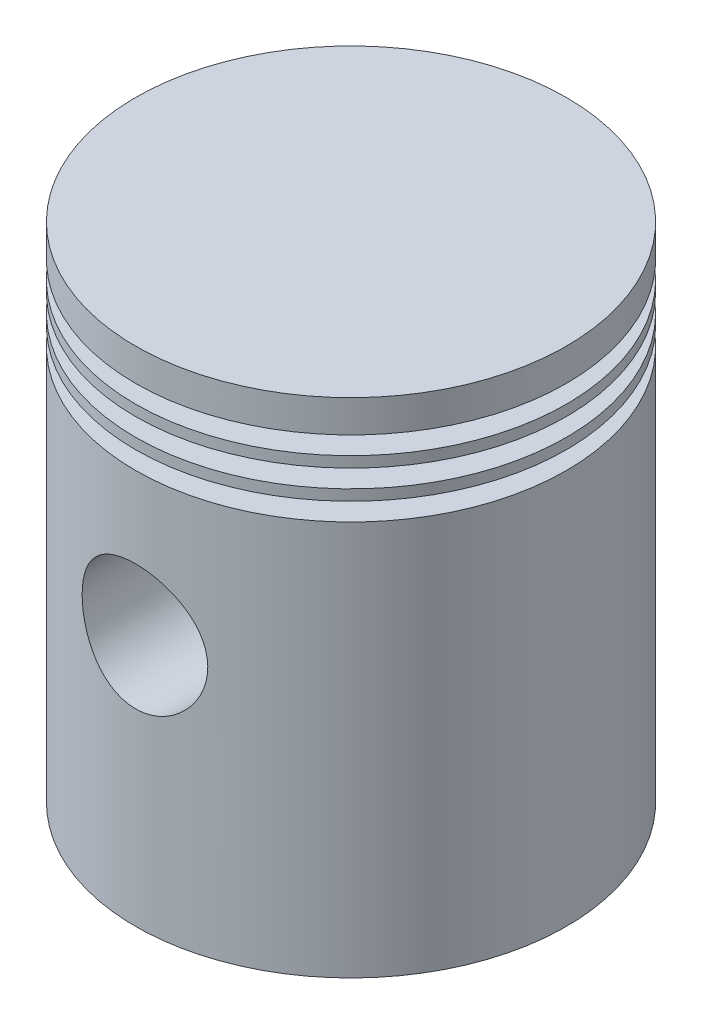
ISO-10303-21;
HEADER;
FILE_DESCRIPTION(('STEP AP214'),'2;1');
FILE_NAME('part.step','',(''),(''),'','','');
FILE_SCHEMA(('AUTOMOTIVE_DESIGN { 1 0 10303 214 1 1 1 1 }'));
ENDSEC;
DATA;
#1=APPLICATION_CONTEXT('core data for automotive mechanical design processes');
#2=APPLICATION_PROTOCOL_DEFINITION('international standard','automotive_design',2000,#1);
#3=PRODUCT_CONTEXT('',#1,'mechanical');
#4=PRODUCT('Part','Part','',(#3));
#5=PRODUCT_RELATED_PRODUCT_CATEGORY('part','',(#4));
#6=PRODUCT_DEFINITION_FORMATION('','',#4);
#7=PRODUCT_DEFINITION_CONTEXT('part definition',#1,'design');
#8=PRODUCT_DEFINITION('design','',#6,#7);
#9=PRODUCT_DEFINITION_SHAPE('','',#8);
#10=(LENGTH_UNIT() NAMED_UNIT(*) SI_UNIT(.MILLI.,.METRE.));
#11=(NAMED_UNIT(*) PLANE_ANGLE_UNIT() SI_UNIT($,.RADIAN.));
#12=(NAMED_UNIT(*) SI_UNIT($,.STERADIAN.) SOLID_ANGLE_UNIT());
#13=UNCERTAINTY_MEASURE_WITH_UNIT(LENGTH_MEASURE(1.E-05),#10,'distance_accuracy_value','');
#14=(GEOMETRIC_REPRESENTATION_CONTEXT(3) GLOBAL_UNCERTAINTY_ASSIGNED_CONTEXT((#13)) GLOBAL_UNIT_ASSIGNED_CONTEXT((#10,
#11,#12)) REPRESENTATION_CONTEXT('',''));
#15=CARTESIAN_POINT('',(0.,0.,0.));
#16=DIRECTION('',(0.,0.,1.));
#17=DIRECTION('',(1.,0.,0.));
#18=AXIS2_PLACEMENT_3D('',#15,#16,#17);
#19=CARTESIAN_POINT('',(0.,88.9,0.));
#20=DIRECTION('',(0.,-1.,0.));
#21=DIRECTION('',(0.,0.,-1.));
#22=AXIS2_PLACEMENT_3D('',#19,#20,#21);
#23=CYLINDRICAL_SURFACE('',#22,38.1);
#24=CARTESIAN_POINT('',(-1.13939569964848E-10,80.01,0.));
#25=DIRECTION('',(0.,1.,0.));
#26=DIRECTION('',(0.,0.,1.));
#27=AXIS2_PLACEMENT_3D('',#24,#25,#26);
#28=CIRCLE('',#27,38.1);
#29=CARTESIAN_POINT('',(-1.13939569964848E-10,80.01,38.1));
#30=VERTEX_POINT('',#29);
#31=EDGE_CURVE('E158',#30,#30,#28,.T.);
#32=ORIENTED_EDGE('',*,*,#31,.F.);
#33=EDGE_LOOP('',(#32));
#34=FACE_BOUND('',#33,.T.);
#35=CARTESIAN_POINT('',(-1.13939569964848E-10,78.105,0.));
#36=DIRECTION('',(0.,1.,0.));
#37=DIRECTION('',(0.,0.,1.));
#38=AXIS2_PLACEMENT_3D('',#35,#36,#37);
#39=CIRCLE('',#38,38.1);
#40=CARTESIAN_POINT('',(-1.13939569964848E-10,78.105,38.1));
#41=VERTEX_POINT('',#40);
#42=EDGE_CURVE('E167',#41,#41,#39,.T.);
#43=ORIENTED_EDGE('',*,*,#42,.T.);
#44=EDGE_LOOP('',(#43));
#45=FACE_BOUND('',#44,.T.);
#46=ADVANCED_FACE('F34',(#34,#45),#23,.T.);
#47=CARTESIAN_POINT('',(0.,88.9,0.));
#48=DIRECTION('',(0.,-1.,0.));
#49=DIRECTION('',(0.,0.,-1.));
#50=AXIS2_PLACEMENT_3D('',#47,#48,#49);
#51=CIRCLE('',#50,38.1);
#52=CARTESIAN_POINT('',(0.,88.9,-38.1));
#53=VERTEX_POINT('',#52);
#54=EDGE_CURVE('E281',#53,#53,#51,.T.);
#55=ORIENTED_EDGE('',*,*,#54,.T.);
#56=EDGE_LOOP('',(#55));
#57=FACE_BOUND('',#56,.T.);
#58=CARTESIAN_POINT('',(-1.13939569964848E-10,83.185,0.));
#59=DIRECTION('',(0.,1.,0.));
#60=DIRECTION('',(0.,0.,1.));
#61=AXIS2_PLACEMENT_3D('',#58,#59,#60);
#62=CIRCLE('',#61,38.1);
#63=CARTESIAN_POINT('',(-1.13939569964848E-10,83.185,38.1));
#64=VERTEX_POINT('',#63);
#65=EDGE_CURVE('E155',#64,#64,#62,.T.);
#66=ORIENTED_EDGE('',*,*,#65,.T.);
#67=EDGE_LOOP('',(#66));
#68=FACE_BOUND('',#67,.T.);
#69=ADVANCED_FACE('F237',(#57,#68),#23,.T.);
#70=CARTESIAN_POINT('',(-1.13939569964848E-10,74.93,0.));
#71=DIRECTION('',(0.,1.,0.));
#72=DIRECTION('',(0.,0.,1.));
#73=AXIS2_PLACEMENT_3D('',#70,#71,#72);
#74=CIRCLE('',#73,38.1);
#75=CARTESIAN_POINT('',(-1.13939569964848E-10,74.93,38.1));
#76=VERTEX_POINT('',#75);
#77=EDGE_CURVE('E170',#76,#76,#74,.T.);
#78=ORIENTED_EDGE('',*,*,#77,.F.);
#79=EDGE_LOOP('',(#78));
#80=FACE_BOUND('',#79,.T.);
#81=CARTESIAN_POINT('',(-1.13939569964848E-10,73.025,0.));
#82=DIRECTION('',(0.,1.,0.));
#83=DIRECTION('',(0.,0.,1.));
#84=AXIS2_PLACEMENT_3D('',#81,#82,#83);
#85=CIRCLE('',#84,38.1);
#86=CARTESIAN_POINT('',(-1.13939569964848E-10,73.025,38.1));
#87=VERTEX_POINT('',#86);
#88=EDGE_CURVE('E179',#87,#87,#85,.T.);
#89=ORIENTED_EDGE('',*,*,#88,.T.);
#90=EDGE_LOOP('',(#89));
#91=FACE_BOUND('',#90,.T.);
#92=ADVANCED_FACE('F242',(#80,#91),#23,.T.);
#93=CARTESIAN_POINT('',(-1.13939569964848E-10,69.85,0.));
#94=DIRECTION('',(0.,1.,0.));
#95=DIRECTION('',(0.,0.,1.));
#96=AXIS2_PLACEMENT_3D('',#93,#94,#95);
#97=CIRCLE('',#96,38.1);
#98=CARTESIAN_POINT('',(-1.13939569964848E-10,69.85,38.1));
#99=VERTEX_POINT('',#98);
#100=EDGE_CURVE('E182',#99,#99,#97,.T.);
#101=ORIENTED_EDGE('',*,*,#100,.F.);
#102=EDGE_LOOP('',(#101));
#103=FACE_BOUND('',#102,.T.);
#104=CARTESIAN_POINT('',(0.,33.3375,-38.1));
#105=CARTESIAN_POINT('',(-0.304937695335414,33.3375007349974,-38.0999994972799));
#106=CARTESIAN_POINT('',(-0.609891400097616,33.3500621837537,-38.0963302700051));
#107=CARTESIAN_POINT('',(-1.21767352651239,33.4002057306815,-38.0817506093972));
#108=CARTESIAN_POINT('',(-1.52050104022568,33.4377979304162,-38.0708372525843));
#109=CARTESIAN_POINT('',(-2.12218389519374,33.5377528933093,-38.0420450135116));
#110=CARTESIAN_POINT('',(-2.42103238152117,33.6001538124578,-38.0241554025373));
#111=CARTESIAN_POINT('',(-3.01216388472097,33.749184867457,-37.981899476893));
#112=CARTESIAN_POINT('',(-3.30444663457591,33.8358159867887,-37.957532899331));
#113=CARTESIAN_POINT('',(-3.87983147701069,34.0323801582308,-37.9030375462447));
#114=CARTESIAN_POINT('',(-4.16295121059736,34.1422649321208,-37.8729207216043));
#115=CARTESIAN_POINT('',(-4.71877629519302,34.3845776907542,-37.8076905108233));
#116=CARTESIAN_POINT('',(-4.99148141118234,34.517006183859,-37.7725770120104));
#117=CARTESIAN_POINT('',(-5.52463144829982,34.8033616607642,-37.6982873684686));
#118=CARTESIAN_POINT('',(-5.78508124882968,34.9572799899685,-37.6591128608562));
#119=CARTESIAN_POINT('',(-6.2923213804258,35.2856309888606,-37.5776889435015));
#120=CARTESIAN_POINT('',(-6.53910712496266,35.4600704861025,-37.5354385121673));
#121=CARTESIAN_POINT('',(-7.0233194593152,35.8327927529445,-37.4478971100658));
#122=CARTESIAN_POINT('',(-7.26036770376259,36.0315556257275,-37.4025569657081));
#123=CARTESIAN_POINT('',(-7.7169919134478,36.44805083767,-37.3110207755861));
#124=CARTESIAN_POINT('',(-7.93656759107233,36.6657834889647,-37.2648247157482));
#125=CARTESIAN_POINT('',(-8.35693780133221,37.118916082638,-37.1728114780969));
#126=CARTESIAN_POINT('',(-8.5577251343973,37.3543227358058,-37.1269944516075));
#127=CARTESIAN_POINT('',(-8.93904847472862,37.8411693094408,-37.0370326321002));
#128=CARTESIAN_POINT('',(-9.11959149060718,38.0926036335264,-36.992887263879));
#129=CARTESIAN_POINT('',(-9.46289379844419,38.6155175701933,-36.9065799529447));
#130=CARTESIAN_POINT('',(-9.62519293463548,38.8873098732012,-36.8644802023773));
#131=CARTESIAN_POINT('',(-9.92624467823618,39.4442506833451,-36.7845611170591));
#132=CARTESIAN_POINT('',(-10.0649968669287,39.7293994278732,-36.7467418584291));
#133=CARTESIAN_POINT('',(-10.3178075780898,40.3110346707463,-36.6765601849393));
#134=CARTESIAN_POINT('',(-10.4318706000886,40.6075190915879,-36.6441967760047));
#135=CARTESIAN_POINT('',(-10.6343444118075,41.2097406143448,-36.5859512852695));
#136=CARTESIAN_POINT('',(-10.7227560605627,41.5154774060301,-36.560068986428));
#137=CARTESIAN_POINT('',(-10.8711158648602,42.125683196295,-36.5162247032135));
#138=CARTESIAN_POINT('',(-10.9317587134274,42.4299695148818,-36.4980703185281));
#139=CARTESIAN_POINT('',(-11.0274167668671,43.0428979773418,-36.4692827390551));
#140=CARTESIAN_POINT('',(-11.0624323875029,43.3515400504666,-36.4586494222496));
#141=CARTESIAN_POINT('',(-11.1064998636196,43.9707819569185,-36.4452492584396));
#142=CARTESIAN_POINT('',(-11.1155568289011,44.2813813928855,-36.442480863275));
#143=CARTESIAN_POINT('',(-11.1076337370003,44.9022135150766,-36.4448966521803));
#144=CARTESIAN_POINT('',(-11.0906542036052,45.2124462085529,-36.450080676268));
#145=CARTESIAN_POINT('',(-11.0318415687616,45.8196692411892,-36.4679224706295));
#146=CARTESIAN_POINT('',(-10.990872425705,46.1167513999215,-36.4803203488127));
#147=CARTESIAN_POINT('',(-10.8851537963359,46.7062706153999,-36.5120044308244));
#148=CARTESIAN_POINT('',(-10.8204049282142,46.9987077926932,-36.5312904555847));
#149=CARTESIAN_POINT('',(-10.6676692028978,47.5769679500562,-36.5761829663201));
#150=CARTESIAN_POINT('',(-10.5796807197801,47.862790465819,-36.601789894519));
#151=CARTESIAN_POINT('',(-10.3811744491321,48.4259290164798,-36.6585851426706));
#152=CARTESIAN_POINT('',(-10.2706561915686,48.7032448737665,-36.6897735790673));
#153=CARTESIAN_POINT('',(-10.0263586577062,49.2511368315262,-36.7572902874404));
#154=CARTESIAN_POINT('',(-9.8922972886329,49.521579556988,-36.793679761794));
#155=CARTESIAN_POINT('',(-9.6028458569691,50.0503471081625,-36.8702828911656));
#156=CARTESIAN_POINT('',(-9.44744844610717,50.3086677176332,-36.9104978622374));
#157=CARTESIAN_POINT('',(-9.11642769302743,50.8115257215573,-36.9936461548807));
#158=CARTESIAN_POINT('',(-8.9408051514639,51.0560636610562,-37.0365793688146));
#159=CARTESIAN_POINT('',(-8.57045998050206,51.5299225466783,-37.1240273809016));
#160=CARTESIAN_POINT('',(-8.3757368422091,51.7592430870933,-37.1685422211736));
#161=CARTESIAN_POINT('',(-7.96035965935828,52.2100208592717,-37.2597589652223));
#162=CARTESIAN_POINT('',(-7.7389862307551,52.4308123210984,-37.3064779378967));
#163=CARTESIAN_POINT('',(-7.27840361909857,52.8529792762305,-37.3990640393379));
#164=CARTESIAN_POINT('',(-7.03919979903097,53.0543605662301,-37.4449314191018));
#165=CARTESIAN_POINT('',(-6.54427129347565,53.4365444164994,-37.5345945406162));
#166=CARTESIAN_POINT('',(-6.28853654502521,53.6173342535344,-37.5783889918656));
#167=CARTESIAN_POINT('',(-5.76233716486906,53.9569011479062,-37.662666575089));
#168=CARTESIAN_POINT('',(-5.49187301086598,54.1156789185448,-37.7031498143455));
#169=CARTESIAN_POINT('',(-4.93609351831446,54.4110412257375,-37.7799444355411));
#170=CARTESIAN_POINT('',(-4.650689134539,54.547466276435,-37.8162253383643));
#171=CARTESIAN_POINT('',(-4.06874203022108,54.7956779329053,-37.8832562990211));
#172=CARTESIAN_POINT('',(-3.77219986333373,54.9074657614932,-37.9140066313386));
#173=CARTESIAN_POINT('',(-3.17064637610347,55.1052676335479,-37.9690407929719));
#174=CARTESIAN_POINT('',(-2.86565116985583,55.1913274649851,-37.9933361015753));
#175=CARTESIAN_POINT('',(-2.24908753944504,55.3371277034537,-38.0348129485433));
#176=CARTESIAN_POINT('',(-1.93752219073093,55.3968801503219,-38.0519977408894));
#177=CARTESIAN_POINT('',(-1.35528771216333,55.4828856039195,-38.0768366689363));
#178=CARTESIAN_POINT('',(-1.08518508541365,55.5127218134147,-38.0855064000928));
#179=CARTESIAN_POINT('',(-0.543392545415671,55.5525293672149,-38.0970882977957));
#180=CARTESIAN_POINT('',(-0.271702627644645,55.5625006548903,-38.1000004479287));
#181=CARTESIAN_POINT('',(0.304937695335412,55.5624992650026,-38.0999994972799));
#182=CARTESIAN_POINT('',(0.609891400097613,55.5499378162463,-38.0963302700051));
#183=CARTESIAN_POINT('',(1.21767352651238,55.4997942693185,-38.0817506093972));
#184=CARTESIAN_POINT('',(1.52050104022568,55.4622020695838,-38.0708372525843));
#185=CARTESIAN_POINT('',(2.12218389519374,55.3622471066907,-38.0420450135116));
#186=CARTESIAN_POINT('',(2.42103238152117,55.2998461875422,-38.0241554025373));
#187=CARTESIAN_POINT('',(3.01216388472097,55.150815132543,-37.981899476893));
#188=CARTESIAN_POINT('',(3.30444663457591,55.0641840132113,-37.957532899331));
#189=CARTESIAN_POINT('',(3.87983147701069,54.8676198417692,-37.9030375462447));
#190=CARTESIAN_POINT('',(4.16295121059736,54.7577350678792,-37.8729207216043));
#191=CARTESIAN_POINT('',(4.71877629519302,54.5154223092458,-37.8076905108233));
#192=CARTESIAN_POINT('',(4.99148141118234,54.382993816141,-37.7725770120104));
#193=CARTESIAN_POINT('',(5.52463144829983,54.0966383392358,-37.6982873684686));
#194=CARTESIAN_POINT('',(5.78508124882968,53.9427200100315,-37.6591128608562));
#195=CARTESIAN_POINT('',(6.2923213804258,53.6143690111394,-37.5776889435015));
#196=CARTESIAN_POINT('',(6.53910712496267,53.4399295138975,-37.5354385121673));
#197=CARTESIAN_POINT('',(7.0233194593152,53.0672072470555,-37.4478971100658));
#198=CARTESIAN_POINT('',(7.2603677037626,52.8684443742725,-37.4025569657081));
#199=CARTESIAN_POINT('',(7.7169919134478,52.45194916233,-37.3110207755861));
#200=CARTESIAN_POINT('',(7.93656759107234,52.2342165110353,-37.2648247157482));
#201=CARTESIAN_POINT('',(8.35693780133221,51.781083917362,-37.1728114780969));
#202=CARTESIAN_POINT('',(8.5577251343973,51.5456772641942,-37.1269944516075));
#203=CARTESIAN_POINT('',(8.93904847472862,51.0588306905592,-37.0370326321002));
#204=CARTESIAN_POINT('',(9.11959149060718,50.8073963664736,-36.992887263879));
#205=CARTESIAN_POINT('',(9.46289379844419,50.2844824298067,-36.9065799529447));
#206=CARTESIAN_POINT('',(9.62519293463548,50.0126901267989,-36.8644802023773));
#207=CARTESIAN_POINT('',(9.92624467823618,49.455749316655,-36.7845611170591));
#208=CARTESIAN_POINT('',(10.0649968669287,49.1706005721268,-36.7467418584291));
#209=CARTESIAN_POINT('',(10.3178075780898,48.5889653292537,-36.6765601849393));
#210=CARTESIAN_POINT('',(10.4318706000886,48.2924809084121,-36.6441967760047));
#211=CARTESIAN_POINT('',(10.6343444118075,47.6902593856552,-36.5859512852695));
#212=CARTESIAN_POINT('',(10.7227560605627,47.3845225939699,-36.560068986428));
#213=CARTESIAN_POINT('',(10.8711158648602,46.774316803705,-36.5162247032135));
#214=CARTESIAN_POINT('',(10.9317587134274,46.4700304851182,-36.4980703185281));
#215=CARTESIAN_POINT('',(11.0274167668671,45.8571020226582,-36.4692827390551));
#216=CARTESIAN_POINT('',(11.0624323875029,45.5484599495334,-36.4586494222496));
#217=CARTESIAN_POINT('',(11.1064998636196,44.9292180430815,-36.4452492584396));
#218=CARTESIAN_POINT('',(11.1155568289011,44.6186186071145,-36.442480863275));
#219=CARTESIAN_POINT('',(11.1076337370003,43.9977864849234,-36.4448966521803));
#220=CARTESIAN_POINT('',(11.0906542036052,43.6875537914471,-36.450080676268));
#221=CARTESIAN_POINT('',(11.0318415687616,43.0803307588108,-36.4679224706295));
#222=CARTESIAN_POINT('',(10.990872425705,42.7832486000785,-36.4803203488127));
#223=CARTESIAN_POINT('',(10.8851537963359,42.1937293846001,-36.5120044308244));
#224=CARTESIAN_POINT('',(10.8204049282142,41.9012922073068,-36.5312904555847));
#225=CARTESIAN_POINT('',(10.6676692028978,41.3230320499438,-36.57618296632));
#226=CARTESIAN_POINT('',(10.5796807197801,41.037209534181,-36.601789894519));
#227=CARTESIAN_POINT('',(10.3811744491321,40.4740709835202,-36.6585851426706));
#228=CARTESIAN_POINT('',(10.2706561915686,40.1967551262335,-36.6897735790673));
#229=CARTESIAN_POINT('',(10.0263586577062,39.6488631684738,-36.7572902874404));
#230=CARTESIAN_POINT('',(9.8922972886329,39.3784204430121,-36.793679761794));
#231=CARTESIAN_POINT('',(9.60284585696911,38.8496528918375,-36.8702828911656));
#232=CARTESIAN_POINT('',(9.44744844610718,38.5913322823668,-36.9104978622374));
#233=CARTESIAN_POINT('',(9.11642769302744,38.0884742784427,-36.9936461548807));
#234=CARTESIAN_POINT('',(8.9408051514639,37.8439363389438,-37.0365793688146));
#235=CARTESIAN_POINT('',(8.57045998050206,37.3700774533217,-37.1240273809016));
#236=CARTESIAN_POINT('',(8.3757368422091,37.1407569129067,-37.1685422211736));
#237=CARTESIAN_POINT('',(7.96035965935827,36.6899791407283,-37.2597589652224));
#238=CARTESIAN_POINT('',(7.7389862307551,36.4691876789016,-37.3064779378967));
#239=CARTESIAN_POINT('',(7.27840361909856,36.0470207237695,-37.3990640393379));
#240=CARTESIAN_POINT('',(7.03919979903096,35.8456394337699,-37.4449314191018));
#241=CARTESIAN_POINT('',(6.54427129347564,35.4634555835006,-37.5345945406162));
#242=CARTESIAN_POINT('',(6.28853654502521,35.2826657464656,-37.5783889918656));
#243=CARTESIAN_POINT('',(5.76233716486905,34.9430988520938,-37.662666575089));
#244=CARTESIAN_POINT('',(5.49187301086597,34.7843210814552,-37.7031498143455));
#245=CARTESIAN_POINT('',(4.93609351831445,34.4889587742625,-37.7799444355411));
#246=CARTESIAN_POINT('',(4.65068913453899,34.352533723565,-37.8162253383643));
#247=CARTESIAN_POINT('',(4.06874203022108,34.1043220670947,-37.8832562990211));
#248=CARTESIAN_POINT('',(3.77219986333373,33.9925342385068,-37.9140066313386));
#249=CARTESIAN_POINT('',(3.17064637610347,33.7947323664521,-37.9690407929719));
#250=CARTESIAN_POINT('',(2.86565116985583,33.7086725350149,-37.9933361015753));
#251=CARTESIAN_POINT('',(2.24908753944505,33.5628722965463,-38.0348129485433));
#252=CARTESIAN_POINT('',(1.93752219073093,33.5031198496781,-38.0519977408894));
#253=CARTESIAN_POINT('',(1.35528771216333,33.4171143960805,-38.0768366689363));
#254=CARTESIAN_POINT('',(1.08518508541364,33.3872781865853,-38.0855064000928));
#255=CARTESIAN_POINT('',(0.54339254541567,33.3474706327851,-38.0970882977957));
#256=CARTESIAN_POINT('',(0.271702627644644,33.3374993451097,-38.1000004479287));
#257=CARTESIAN_POINT('',(0.,33.3375,-38.1));
#258=B_SPLINE_CURVE_WITH_KNOTS('',3,(#104,#105,#106,#107,#108,#109,#110,#111,#112,#113,#114,
#115,#116,#117,#118,#119,#120,#121,#122,#123,#124,#125,#126,#127,#128,#129,#130,#131,#132,#133,
#134,#135,#136,#137,#138,#139,#140,#141,#142,#143,#144,#145,#146,#147,#148,#149,#150,#151,#152,
#153,#154,#155,#156,#157,#158,#159,#160,#161,#162,#163,#164,#165,#166,#167,#168,#169,#170,#171,
#172,#173,#174,#175,#176,#177,#178,#179,#180,#181,#182,#183,#184,#185,#186,#187,#188,#189,#190,
#191,#192,#193,#194,#195,#196,#197,#198,#199,#200,#201,#202,#203,#204,#205,#206,#207,#208,#209,
#210,#211,#212,#213,#214,#215,#216,#217,#218,#219,#220,#221,#222,#223,#224,#225,#226,#227,#228,
#229,#230,#231,#232,#233,#234,#235,#236,#237,#238,#239,#240,#241,#242,#243,#244,#245,#246,#247,
#248,#249,#250,#251,#252,#253,#254,#255,#256,#257),.UNSPECIFIED.,.T.,.F.,(4,2,2,2,2,2,2,2,2,2,2,
2,2,2,2,2,2,2,2,2,2,2,2,2,2,2,2,2,2,2,2,2,2,2,2,2,2,2,2,2,2,2,2,2,2,2,2,2,2,2,2,2,2,2,2,2,2,2,2,
2,2,2,2,2,2,2,2,2,2,2,2,2,2,2,2,2,4),(0.,0.914561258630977,1.8294918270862,2.74583504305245,
3.66221545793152,4.57671166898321,5.49122850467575,6.40537809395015,7.31983269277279,
8.25673032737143,9.1936433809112,10.1309139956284,11.0678591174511,12.0247410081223,
12.9816399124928,13.9383642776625,14.8950565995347,15.8262960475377,16.7575203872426,
17.6885614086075,18.6195837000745,19.5189759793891,20.4183448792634,21.3177767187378,
22.2172273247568,23.1282992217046,24.0396856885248,24.9510360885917,25.8624107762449,
26.809692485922,27.7566904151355,28.7042703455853,29.651819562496,30.6058599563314,
31.5598529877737,32.5121379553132,33.4639866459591,34.2788678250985,35.0937513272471,
36.0083125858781,36.9232431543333,37.8395863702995,38.7559667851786,39.6704629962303,
40.5849798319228,41.4991294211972,42.4135840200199,43.3504816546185,44.2873947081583,
45.2246653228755,46.1616104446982,47.1184923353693,48.0753912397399,49.0321156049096,
49.9888079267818,50.9200473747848,51.8512717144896,52.7823127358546,53.7133350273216,
54.6127273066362,55.5120962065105,56.4115280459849,57.3109786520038,58.2220505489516,
59.1334370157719,60.0447874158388,60.956162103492,61.9034438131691,62.8504417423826,
63.7980216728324,64.7455708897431,65.6996112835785,66.6536043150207,67.6058892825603,
68.5577379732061,69.3726191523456,70.1875026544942),.UNSPECIFIED.);
#259=CARTESIAN_POINT('',(0.,33.3375,-38.1));
#260=VERTEX_POINT('',#259);
#261=EDGE_CURVE('E85',#260,#260,#258,.T.);
#262=ORIENTED_EDGE('',*,*,#261,.F.);
#263=EDGE_LOOP('',(#262));
#264=FACE_BOUND('',#263,.T.);
#265=CARTESIAN_POINT('',(2.58462887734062E-13,33.3375,38.1));
#266=CARTESIAN_POINT('',(-0.304937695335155,33.3375007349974,38.0999994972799));
#267=CARTESIAN_POINT('',(-0.609891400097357,33.3500621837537,38.0963302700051));
#268=CARTESIAN_POINT('',(-1.21767352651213,33.4002057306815,38.0817506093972));
#269=CARTESIAN_POINT('',(-1.52050104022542,33.4377979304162,38.0708372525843));
#270=CARTESIAN_POINT('',(-2.12218389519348,33.5377528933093,38.0420450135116));
#271=CARTESIAN_POINT('',(-2.42103238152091,33.6001538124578,38.0241554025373));
#272=CARTESIAN_POINT('',(-3.01216388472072,33.7491848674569,37.9818994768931));
#273=CARTESIAN_POINT('',(-3.30444663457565,33.8358159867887,37.957532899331));
#274=CARTESIAN_POINT('',(-3.87983147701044,34.0323801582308,37.9030375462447));
#275=CARTESIAN_POINT('',(-4.16295121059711,34.1422649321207,37.8729207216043));
#276=CARTESIAN_POINT('',(-4.71877629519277,34.3845776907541,37.8076905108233));
#277=CARTESIAN_POINT('',(-4.99148141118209,34.5170061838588,37.7725770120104));
#278=CARTESIAN_POINT('',(-5.52463144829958,34.803361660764,37.6982873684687));
#279=CARTESIAN_POINT('',(-5.78508124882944,34.9572799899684,37.6591128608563));
#280=CARTESIAN_POINT('',(-6.29232138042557,35.2856309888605,37.5776889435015));
#281=CARTESIAN_POINT('',(-6.53910712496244,35.4600704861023,37.5354385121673));
#282=CARTESIAN_POINT('',(-7.02331945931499,35.8327927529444,37.4478971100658));
#283=CARTESIAN_POINT('',(-7.26036770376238,36.0315556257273,37.4025569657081));
#284=CARTESIAN_POINT('',(-7.7169919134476,36.4480508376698,37.3110207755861));
#285=CARTESIAN_POINT('',(-7.93656759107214,36.6657834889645,37.2648247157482));
#286=CARTESIAN_POINT('',(-8.35693780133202,37.1189160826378,37.1728114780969));
#287=CARTESIAN_POINT('',(-8.55772513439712,37.3543227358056,37.1269944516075));
#288=CARTESIAN_POINT('',(-8.93904847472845,37.8411693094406,37.0370326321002));
#289=CARTESIAN_POINT('',(-9.11959149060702,38.0926036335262,36.992887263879));
#290=CARTESIAN_POINT('',(-9.46289379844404,38.6155175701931,36.9065799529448));
#291=CARTESIAN_POINT('',(-9.62519293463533,38.8873098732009,36.8644802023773));
#292=CARTESIAN_POINT('',(-9.92624467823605,39.4442506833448,36.7845611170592));
#293=CARTESIAN_POINT('',(-10.0649968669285,39.729399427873,36.7467418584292));
#294=CARTESIAN_POINT('',(-10.3178075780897,40.311034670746,36.6765601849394));
#295=CARTESIAN_POINT('',(-10.4318706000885,40.6075190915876,36.6441967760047));
#296=CARTESIAN_POINT('',(-10.6343444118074,41.2097406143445,36.5859512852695));
#297=CARTESIAN_POINT('',(-10.7227560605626,41.5154774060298,36.5600689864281));
#298=CARTESIAN_POINT('',(-10.8711158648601,42.1256831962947,36.5162247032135));
#299=CARTESIAN_POINT('',(-10.9317587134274,42.4299695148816,36.4980703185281));
#300=CARTESIAN_POINT('',(-11.0274167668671,43.0428979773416,36.4692827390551));
#301=CARTESIAN_POINT('',(-11.0624323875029,43.3515400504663,36.4586494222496));
#302=CARTESIAN_POINT('',(-11.1064998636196,43.9707819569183,36.4452492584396));
#303=CARTESIAN_POINT('',(-11.1155568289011,44.2813813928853,36.442480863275));
#304=CARTESIAN_POINT('',(-11.1076337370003,44.9022135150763,36.4448966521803));
#305=CARTESIAN_POINT('',(-11.0906542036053,45.2124462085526,36.450080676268));
#306=CARTESIAN_POINT('',(-11.0318415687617,45.819669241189,36.4679224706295));
#307=CARTESIAN_POINT('',(-10.9908724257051,46.1167513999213,36.4803203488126));
#308=CARTESIAN_POINT('',(-10.885153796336,46.7062706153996,36.5120044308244));
#309=CARTESIAN_POINT('',(-10.8204049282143,46.998707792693,36.5312904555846));
#310=CARTESIAN_POINT('',(-10.6676692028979,47.5769679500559,36.57618296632));
#311=CARTESIAN_POINT('',(-10.5796807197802,47.8627904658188,36.601789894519));
#312=CARTESIAN_POINT('',(-10.3811744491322,48.4259290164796,36.6585851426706));
#313=CARTESIAN_POINT('',(-10.2706561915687,48.7032448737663,36.6897735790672));
#314=CARTESIAN_POINT('',(-10.0263586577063,49.251136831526,36.7572902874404));
#315=CARTESIAN_POINT('',(-9.89229728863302,49.5215795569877,36.793679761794));
#316=CARTESIAN_POINT('',(-9.60284585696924,50.0503471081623,36.8702828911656));
#317=CARTESIAN_POINT('',(-9.44744844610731,50.308667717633,36.9104978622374));
#318=CARTESIAN_POINT('',(-9.11642769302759,50.8115257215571,36.9936461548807));
#319=CARTESIAN_POINT('',(-8.94080515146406,51.056063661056,37.0365793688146));
#320=CARTESIAN_POINT('',(-8.57045998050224,51.5299225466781,37.1240273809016));
#321=CARTESIAN_POINT('',(-8.37573684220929,51.7592430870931,37.1685422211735));
#322=CARTESIAN_POINT('',(-7.96035965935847,52.2100208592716,37.2597589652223));
#323=CARTESIAN_POINT('',(-7.73898623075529,52.4308123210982,37.3064779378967));
#324=CARTESIAN_POINT('',(-7.27840361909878,52.8529792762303,37.3990640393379));
#325=CARTESIAN_POINT('',(-7.03919979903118,53.0543605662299,37.4449314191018));
#326=CARTESIAN_POINT('',(-6.54427129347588,53.4365444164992,37.5345945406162));
#327=CARTESIAN_POINT('',(-6.28853654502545,53.6173342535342,37.5783889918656));
#328=CARTESIAN_POINT('',(-5.7623371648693,53.9569011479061,37.662666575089));
#329=CARTESIAN_POINT('',(-5.49187301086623,54.1156789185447,37.7031498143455));
#330=CARTESIAN_POINT('',(-4.93609351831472,54.4110412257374,37.7799444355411));
#331=CARTESIAN_POINT('',(-4.65068913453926,54.5474662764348,37.8162253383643));
#332=CARTESIAN_POINT('',(-4.06874203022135,54.7956779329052,37.8832562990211));
#333=CARTESIAN_POINT('',(-3.772199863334,54.9074657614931,37.9140066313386));
#334=CARTESIAN_POINT('',(-3.17064637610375,55.1052676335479,37.9690407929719));
#335=CARTESIAN_POINT('',(-2.8656511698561,55.1913274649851,37.9933361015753));
#336=CARTESIAN_POINT('',(-2.24908753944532,55.3371277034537,38.0348129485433));
#337=CARTESIAN_POINT('',(-1.9375221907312,55.3968801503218,38.0519977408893));
#338=CARTESIAN_POINT('',(-1.35528771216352,55.4828856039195,38.0768366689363));
#339=CARTESIAN_POINT('',(-1.08518508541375,55.5127218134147,38.0855064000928));
#340=CARTESIAN_POINT('',(-0.543392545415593,55.552529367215,38.0970882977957));
#341=CARTESIAN_POINT('',(-0.271702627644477,55.5625006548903,38.1000004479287));
#342=CARTESIAN_POINT('',(0.304937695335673,55.5624992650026,38.0999994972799));
#343=CARTESIAN_POINT('',(0.609891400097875,55.5499378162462,38.0963302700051));
#344=CARTESIAN_POINT('',(1.21767352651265,55.4997942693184,38.0817506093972));
#345=CARTESIAN_POINT('',(1.52050104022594,55.4622020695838,38.0708372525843));
#346=CARTESIAN_POINT('',(2.122183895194,55.3622471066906,38.0420450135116));
#347=CARTESIAN_POINT('',(2.42103238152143,55.2998461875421,38.0241554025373));
#348=CARTESIAN_POINT('',(3.01216388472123,55.150815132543,37.981899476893));
#349=CARTESIAN_POINT('',(3.30444663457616,55.0641840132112,37.957532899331));
#350=CARTESIAN_POINT('',(3.87983147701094,54.8676198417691,37.9030375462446));
#351=CARTESIAN_POINT('',(4.16295121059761,54.7577350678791,37.8729207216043));
#352=CARTESIAN_POINT('',(4.71877629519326,54.5154223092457,37.8076905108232));
#353=CARTESIAN_POINT('',(4.99148141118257,54.3829938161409,37.7725770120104));
#354=CARTESIAN_POINT('',(5.52463144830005,54.0966383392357,37.6982873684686));
#355=CARTESIAN_POINT('',(5.7850812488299,53.9427200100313,37.6591128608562));
#356=CARTESIAN_POINT('',(6.29232138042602,53.6143690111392,37.5776889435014));
#357=CARTESIAN_POINT('',(6.53910712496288,53.4399295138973,37.5354385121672));
#358=CARTESIAN_POINT('',(7.02331945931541,53.0672072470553,37.4478971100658));
#359=CARTESIAN_POINT('',(7.2603677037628,52.8684443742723,37.402556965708));
#360=CARTESIAN_POINT('',(7.71699191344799,52.4519491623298,37.3110207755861));
#361=CARTESIAN_POINT('',(7.93656759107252,52.2342165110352,37.2648247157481));
#362=CARTESIAN_POINT('',(8.35693780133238,51.7810839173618,37.1728114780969));
#363=CARTESIAN_POINT('',(8.55772513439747,51.545677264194,37.1269944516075));
#364=CARTESIAN_POINT('',(8.93904847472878,51.058830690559,37.0370326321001));
#365=CARTESIAN_POINT('',(9.11959149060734,50.8073963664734,36.9928872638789));
#366=CARTESIAN_POINT('',(9.46289379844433,50.2844824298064,36.9065799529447));
#367=CARTESIAN_POINT('',(9.62519293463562,50.0126901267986,36.8644802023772));
#368=CARTESIAN_POINT('',(9.92624467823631,49.4557493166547,36.7845611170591));
#369=CARTESIAN_POINT('',(10.0649968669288,49.1706005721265,36.7467418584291));
#370=CARTESIAN_POINT('',(10.3178075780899,48.5889653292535,36.6765601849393));
#371=CARTESIAN_POINT('',(10.4318706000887,48.2924809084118,36.6441967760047));
#372=CARTESIAN_POINT('',(10.6343444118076,47.6902593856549,36.5859512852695));
#373=CARTESIAN_POINT('',(10.7227560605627,47.3845225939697,36.560068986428));
#374=CARTESIAN_POINT('',(10.8711158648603,46.7743168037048,36.5162247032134));
#375=CARTESIAN_POINT('',(10.9317587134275,46.4700304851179,36.4980703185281));
#376=CARTESIAN_POINT('',(11.0274167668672,45.8571020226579,36.4692827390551));
#377=CARTESIAN_POINT('',(11.0624323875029,45.5484599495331,36.4586494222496));
#378=CARTESIAN_POINT('',(11.1064998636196,44.9292180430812,36.4452492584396));
#379=CARTESIAN_POINT('',(11.1155568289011,44.6186186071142,36.442480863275));
#380=CARTESIAN_POINT('',(11.1076337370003,43.9977864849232,36.4448966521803));
#381=CARTESIAN_POINT('',(11.0906542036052,43.6875537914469,36.450080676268));
#382=CARTESIAN_POINT('',(11.0318415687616,43.0803307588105,36.4679224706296));
#383=CARTESIAN_POINT('',(10.990872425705,42.7832486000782,36.4803203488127));
#384=CARTESIAN_POINT('',(10.8851537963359,42.1937293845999,36.5120044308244));
#385=CARTESIAN_POINT('',(10.8204049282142,41.9012922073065,36.5312904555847));
#386=CARTESIAN_POINT('',(10.6676692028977,41.3230320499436,36.5761829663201));
#387=CARTESIAN_POINT('',(10.57968071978,41.0372095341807,36.601789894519));
#388=CARTESIAN_POINT('',(10.381174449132,40.47407098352,36.6585851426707));
#389=CARTESIAN_POINT('',(10.2706561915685,40.1967551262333,36.6897735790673));
#390=CARTESIAN_POINT('',(10.0263586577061,39.6488631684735,36.7572902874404));
#391=CARTESIAN_POINT('',(9.89229728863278,39.3784204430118,36.793679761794));
#392=CARTESIAN_POINT('',(9.60284585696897,38.8496528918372,36.8702828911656));
#393=CARTESIAN_POINT('',(9.44744844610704,38.5913322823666,36.9104978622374));
#394=CARTESIAN_POINT('',(9.11642769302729,38.0884742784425,36.9936461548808));
#395=CARTESIAN_POINT('',(8.94080515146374,37.8439363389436,37.0365793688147));
#396=CARTESIAN_POINT('',(8.5704599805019,37.3700774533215,37.1240273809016));
#397=CARTESIAN_POINT('',(8.37573684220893,37.1407569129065,37.1685422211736));
#398=CARTESIAN_POINT('',(7.96035965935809,36.6899791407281,37.2597589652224));
#399=CARTESIAN_POINT('',(7.73898623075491,36.4691876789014,37.3064779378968));
#400=CARTESIAN_POINT('',(7.27840361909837,36.0470207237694,37.3990640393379));
#401=CARTESIAN_POINT('',(7.03919979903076,35.8456394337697,37.4449314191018));
#402=CARTESIAN_POINT('',(6.54427129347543,35.4634555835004,37.5345945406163));
#403=CARTESIAN_POINT('',(6.28853654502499,35.2826657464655,37.5783889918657));
#404=CARTESIAN_POINT('',(5.76233716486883,34.9430988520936,37.662666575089));
#405=CARTESIAN_POINT('',(5.49187301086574,34.7843210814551,37.7031498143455));
#406=CARTESIAN_POINT('',(4.93609351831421,34.4889587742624,37.7799444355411));
#407=CARTESIAN_POINT('',(4.65068913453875,34.3525337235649,37.8162253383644));
#408=CARTESIAN_POINT('',(4.06874203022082,34.1043220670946,37.8832562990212));
#409=CARTESIAN_POINT('',(3.77219986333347,33.9925342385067,37.9140066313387));
#410=CARTESIAN_POINT('',(3.17064637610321,33.794732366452,37.969040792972));
#411=CARTESIAN_POINT('',(2.86565116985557,33.7086725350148,37.9933361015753));
#412=CARTESIAN_POINT('',(2.24908753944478,33.5628722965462,38.0348129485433));
#413=CARTESIAN_POINT('',(1.93752219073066,33.5031198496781,38.0519977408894));
#414=CARTESIAN_POINT('',(1.35528771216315,33.4171143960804,38.0768366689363));
#415=CARTESIAN_POINT('',(1.08518508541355,33.3872781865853,38.0855064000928));
#416=CARTESIAN_POINT('',(0.543392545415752,33.3474706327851,38.0970882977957));
#417=CARTESIAN_POINT('',(0.271702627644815,33.3374993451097,38.1000004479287));
#418=CARTESIAN_POINT('',(2.58462887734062E-13,33.3375,38.1));
#419=B_SPLINE_CURVE_WITH_KNOTS('',3,(#265,#266,#267,#268,#269,#270,#271,#272,#273,#274,#275,
#276,#277,#278,#279,#280,#281,#282,#283,#284,#285,#286,#287,#288,#289,#290,#291,#292,#293,#294,
#295,#296,#297,#298,#299,#300,#301,#302,#303,#304,#305,#306,#307,#308,#309,#310,#311,#312,#313,
#314,#315,#316,#317,#318,#319,#320,#321,#322,#323,#324,#325,#326,#327,#328,#329,#330,#331,#332,
#333,#334,#335,#336,#337,#338,#339,#340,#341,#342,#343,#344,#345,#346,#347,#348,#349,#350,#351,
#352,#353,#354,#355,#356,#357,#358,#359,#360,#361,#362,#363,#364,#365,#366,#367,#368,#369,#370,
#371,#372,#373,#374,#375,#376,#377,#378,#379,#380,#381,#382,#383,#384,#385,#386,#387,#388,#389,
#390,#391,#392,#393,#394,#395,#396,#397,#398,#399,#400,#401,#402,#403,#404,#405,#406,#407,#408,
#409,#410,#411,#412,#413,#414,#415,#416,#417,#418),.UNSPECIFIED.,.T.,.F.,(4,2,2,2,2,2,2,2,2,2,2,
2,2,2,2,2,2,2,2,2,2,2,2,2,2,2,2,2,2,2,2,2,2,2,2,2,2,2,2,2,2,2,2,2,2,2,2,2,2,2,2,2,2,2,2,2,2,2,2,
2,2,2,2,2,2,2,2,2,2,2,2,2,2,2,2,2,4),(0.,0.914561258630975,1.8294918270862,2.74583504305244,
3.66221545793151,4.5767116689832,5.49122850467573,6.40537809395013,7.31983269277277,
8.25673032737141,9.19364338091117,10.1309139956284,11.0678591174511,12.0247410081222,
12.9816399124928,13.9383642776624,14.8950565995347,15.8262960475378,16.7575203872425,
17.6885614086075,18.6195837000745,19.5189759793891,20.4183448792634,21.3177767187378,
22.2172273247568,23.1282992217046,24.0396856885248,24.9510360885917,25.8624107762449,
26.809692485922,27.7566904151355,28.7042703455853,29.651819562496,30.6058599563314,
31.5598529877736,32.5121379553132,33.463986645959,34.2788678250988,35.0937513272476,
36.0083125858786,36.9232431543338,37.8395863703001,38.7559667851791,39.6704629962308,
40.5849798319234,41.4991294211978,42.4135840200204,43.3504816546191,44.2873947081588,
45.224665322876,46.1616104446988,47.1184923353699,48.0753912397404,49.0321156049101,
49.9888079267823,50.9200473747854,51.8512717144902,52.7823127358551,53.7133350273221,
54.6127273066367,55.5120962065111,56.4115280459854,57.3109786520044,58.2220505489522,
59.1334370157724,60.0447874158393,60.9561621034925,61.9034438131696,62.8504417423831,
63.7980216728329,64.7455708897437,65.699611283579,66.6536043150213,67.6058892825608,
68.5577379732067,69.3726191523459,70.1875026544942),.UNSPECIFIED.);
#420=CARTESIAN_POINT('',(2.58462887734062E-13,33.3375,38.1));
#421=VERTEX_POINT('',#420);
#422=EDGE_CURVE('E188',#421,#421,#419,.T.);
#423=ORIENTED_EDGE('',*,*,#422,.T.);
#424=EDGE_LOOP('',(#423));
#425=FACE_BOUND('',#424,.T.);
#426=CARTESIAN_POINT('',(0.,0.,0.));
#427=DIRECTION('',(0.,-1.,0.));
#428=DIRECTION('',(0.,0.,-1.));
#429=AXIS2_PLACEMENT_3D('',#426,#427,#428);
#430=CIRCLE('',#429,38.1);
#431=CARTESIAN_POINT('',(0.,0.,-38.1));
#432=VERTEX_POINT('',#431);
#433=EDGE_CURVE('E11',#432,#432,#430,.T.);
#434=ORIENTED_EDGE('',*,*,#433,.F.);
#435=EDGE_LOOP('',(#434));
#436=FACE_BOUND('',#435,.T.);
#437=ADVANCED_FACE('F116',(#103,#264,#425,#436),#23,.T.);
#438=CARTESIAN_POINT('',(0.,44.45,13.208));
#439=DIRECTION('',(0.,0.,1.));
#440=DIRECTION('',(1.,0.,0.));
#441=AXIS2_PLACEMENT_3D('',#438,#439,#440);
#442=PLANE('',#441);
#443=CARTESIAN_POINT('',(0.,44.45,13.208));
#444=DIRECTION('',(0.,0.,1.));
#445=DIRECTION('',(1.,0.,0.));
#446=AXIS2_PLACEMENT_3D('',#443,#444,#445);
#447=CIRCLE('',#446,14.2875);
#448=CARTESIAN_POINT('',(14.2875,44.45,13.208));
#449=VERTEX_POINT('',#448);
#450=EDGE_CURVE('E222',#449,#449,#447,.T.);
#451=ORIENTED_EDGE('',*,*,#450,.F.);
#452=EDGE_LOOP('',(#451));
#453=FACE_BOUND('',#452,.T.);
#454=CARTESIAN_POINT('',(0.,44.45,13.208));
#455=DIRECTION('',(0.,0.,1.));
#456=DIRECTION('',(1.,0.,0.));
#457=AXIS2_PLACEMENT_3D('',#454,#455,#456);
#458=CIRCLE('',#457,11.1125);
#459=CARTESIAN_POINT('',(11.1125,44.45,13.208));
#460=VERTEX_POINT('',#459);
#461=EDGE_CURVE('E185',#460,#460,#458,.T.);
#462=ORIENTED_EDGE('',*,*,#461,.T.);
#463=EDGE_LOOP('',(#462));
#464=FACE_BOUND('',#463,.T.);
#465=ADVANCED_FACE('F213',(#453,#464),#442,.F.);
#466=CARTESIAN_POINT('',(0.,88.9,0.));
#467=DIRECTION('',(0.,-1.,0.));
#468=DIRECTION('',(0.,0.,-1.));
#469=AXIS2_PLACEMENT_3D('',#466,#467,#468);
#470=CYLINDRICAL_SURFACE('',#469,34.925);
#471=CARTESIAN_POINT('',(0.,4.7625,0.));
#472=DIRECTION('',(0.,-1.,0.));
#473=DIRECTION('',(0.,0.,-1.));
#474=AXIS2_PLACEMENT_3D('',#471,#472,#473);
#475=CIRCLE('',#474,34.925);
#476=CARTESIAN_POINT('',(0.,4.7625,-34.925));
#477=VERTEX_POINT('',#476);
#478=EDGE_CURVE('E271',#477,#477,#475,.T.);
#479=ORIENTED_EDGE('',*,*,#478,.T.);
#480=EDGE_LOOP('',(#479));
#481=FACE_BOUND('',#480,.T.);
#482=CARTESIAN_POINT('',(14.2874999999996,44.45,-31.8688400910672));
#483=CARTESIAN_POINT('',(14.2875008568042,44.2582158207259,-31.868837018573));
#484=CARTESIAN_POINT('',(14.2836376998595,44.0664572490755,-31.8705719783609));
#485=CARTESIAN_POINT('',(14.2682031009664,43.683320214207,-31.8774859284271));
#486=CARTESIAN_POINT('',(14.2566319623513,43.4919417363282,-31.8826647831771));
#487=CARTESIAN_POINT('',(14.2104048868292,42.919084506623,-31.903310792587));
#488=CARTESIAN_POINT('',(14.1642352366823,42.5386448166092,-31.9238874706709));
#489=CARTESIAN_POINT('',(14.0419600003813,41.7852020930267,-31.9778578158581));
#490=CARTESIAN_POINT('',(13.9659773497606,41.4121750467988,-32.0111988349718));
#491=CARTESIAN_POINT('',(13.7848648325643,40.6745010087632,-32.0896066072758));
#492=CARTESIAN_POINT('',(13.6797330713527,40.3098545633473,-32.134674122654));
#493=CARTESIAN_POINT('',(13.4415052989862,39.5918647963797,-32.2350464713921));
#494=CARTESIAN_POINT('',(13.3084486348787,39.2385063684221,-32.2903368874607));
#495=CARTESIAN_POINT('',(13.0153731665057,38.5445232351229,-32.4095773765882));
#496=CARTESIAN_POINT('',(12.855344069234,38.2039034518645,-32.4735307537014));
#497=CARTESIAN_POINT('',(12.5094943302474,37.5372364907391,-32.60832134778));
#498=CARTESIAN_POINT('',(12.3236609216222,37.2111966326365,-32.6791619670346));
#499=CARTESIAN_POINT('',(11.9274289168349,36.5753898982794,-32.8258541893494));
#500=CARTESIAN_POINT('',(11.7170189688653,36.2656306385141,-32.9017081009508));
#501=CARTESIAN_POINT('',(11.261028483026,35.6478934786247,-33.0606447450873));
#502=CARTESIAN_POINT('',(11.0141659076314,35.3409048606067,-33.1438969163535));
#503=CARTESIAN_POINT('',(10.4962380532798,34.7486420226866,-33.3115394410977));
#504=CARTESIAN_POINT('',(10.225182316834,34.4633593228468,-33.395929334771));
#505=CARTESIAN_POINT('',(9.66009151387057,33.9157608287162,-33.5637479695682));
#506=CARTESIAN_POINT('',(9.36603936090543,33.6534624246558,-33.6471759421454));
#507=CARTESIAN_POINT('',(8.75685611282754,33.1537495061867,-33.8108344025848));
#508=CARTESIAN_POINT('',(8.44173287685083,32.9163257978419,-33.8910660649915));
#509=CARTESIAN_POINT('',(7.77829114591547,32.4583320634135,-34.0495956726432));
#510=CARTESIAN_POINT('',(7.42913251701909,32.2388987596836,-34.1276685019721));
#511=CARTESIAN_POINT('',(6.71183345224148,31.8304003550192,-34.2759540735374));
#512=CARTESIAN_POINT('',(6.34369144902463,31.6413377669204,-34.3461661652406));
#513=CARTESIAN_POINT('',(5.59133622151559,31.2955010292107,-34.4766324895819));
#514=CARTESIAN_POINT('',(5.20714108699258,31.1386916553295,-34.5368975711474));
#515=CARTESIAN_POINT('',(4.42513595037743,30.8587087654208,-34.6457717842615));
#516=CARTESIAN_POINT('',(4.02732947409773,30.7355266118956,-34.6943839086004));
#517=CARTESIAN_POINT('',(3.32987111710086,30.5526140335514,-34.7671589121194));
#518=CARTESIAN_POINT('',(3.03264707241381,30.4847298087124,-34.7943803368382));
#519=CARTESIAN_POINT('',(2.43390728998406,30.3680348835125,-34.8413811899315));
#520=CARTESIAN_POINT('',(2.13239200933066,30.3192221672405,-34.8611614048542));
#521=CARTESIAN_POINT('',(1.52643069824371,30.2409888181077,-34.8929461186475));
#522=CARTESIAN_POINT('',(1.22198450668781,30.2115692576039,-34.9049501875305));
#523=CARTESIAN_POINT('',(0.61170094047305,30.1723261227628,-34.9209769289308));
#524=CARTESIAN_POINT('',(0.305863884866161,30.1624982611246,-34.925001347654));
#525=CARTESIAN_POINT('',(-0.383942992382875,30.1625021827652,-34.9249983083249));
#526=CARTESIAN_POINT('',(-0.767928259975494,30.1779929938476,-34.9186531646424));
#527=CARTESIAN_POINT('',(-1.53302485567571,30.2397978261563,-34.8934383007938));
#528=CARTESIAN_POINT('',(-1.91413575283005,30.2861163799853,-34.8745667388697));
#529=CARTESIAN_POINT('',(-2.67087462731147,30.4091268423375,-34.8247889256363));
#530=CARTESIAN_POINT('',(-3.04649893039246,30.4858382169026,-34.7938749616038));
#531=CARTESIAN_POINT('',(-3.78932596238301,30.6688536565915,-34.7208285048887));
#532=CARTESIAN_POINT('',(-4.15652894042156,30.7751568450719,-34.6786963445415));
#533=CARTESIAN_POINT('',(-4.87910728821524,31.0160271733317,-34.5844235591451));
#534=CARTESIAN_POINT('',(-5.23451145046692,31.1505185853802,-34.5323097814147));
#535=CARTESIAN_POINT('',(-5.93230657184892,31.4467667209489,-34.4193013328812));
#536=CARTESIAN_POINT('',(-6.27469746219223,31.6085235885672,-34.358406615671));
#537=CARTESIAN_POINT('',(-6.9444609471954,31.9580108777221,-34.2293207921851));
#538=CARTESIAN_POINT('',(-7.27183499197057,32.145738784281,-34.1611303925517));
#539=CARTESIAN_POINT('',(-7.90996366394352,32.5459235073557,-34.019038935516));
#540=CARTESIAN_POINT('',(-8.22071173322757,32.7583899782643,-33.945135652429));
#541=CARTESIAN_POINT('',(-8.83711874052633,33.2164858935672,-33.7900332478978));
#542=CARTESIAN_POINT('',(-9.14195563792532,33.4631616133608,-33.7086562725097));
#543=CARTESIAN_POINT('',(-9.73013166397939,33.980488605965,-33.5436062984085));
#544=CARTESIAN_POINT('',(-10.0134609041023,34.2511507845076,-33.4599322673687));
#545=CARTESIAN_POINT('',(-10.5569980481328,34.8148671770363,-33.292436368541));
#546=CARTESIAN_POINT('',(-10.8172002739,35.1079268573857,-33.208614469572));
#547=CARTESIAN_POINT('',(-11.3129148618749,35.7147771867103,-33.0430308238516));
#548=CARTESIAN_POINT('',(-11.5484272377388,36.0285678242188,-32.9612690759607));
#549=CARTESIAN_POINT('',(-12.0039594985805,36.6907011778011,-32.7981995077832));
#550=CARTESIAN_POINT('',(-12.2226979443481,37.0399788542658,-32.7171008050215));
#551=CARTESIAN_POINT('',(-12.6296947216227,37.7572127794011,-32.5621537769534));
#552=CARTESIAN_POINT('',(-12.8179657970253,38.1251611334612,-32.488302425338));
#553=CARTESIAN_POINT('',(-13.1623259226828,38.8771471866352,-32.3503198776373));
#554=CARTESIAN_POINT('',(-13.3184458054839,39.2611690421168,-32.2861793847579));
#555=CARTESIAN_POINT('',(-13.5971382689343,40.0428964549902,-32.169804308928));
#556=CARTESIAN_POINT('',(-13.719719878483,40.4405982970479,-32.1175665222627));
#557=CARTESIAN_POINT('',(-13.9012054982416,41.1362843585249,-32.0393348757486));
#558=CARTESIAN_POINT('',(-13.9683555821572,41.4317794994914,-32.0100710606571));
#559=CARTESIAN_POINT('',(-14.0838155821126,42.0270516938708,-31.9594388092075));
#560=CARTESIAN_POINT('',(-14.1321297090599,42.3268277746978,-31.9380686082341));
#561=CARTESIAN_POINT('',(-14.2096368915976,42.9296998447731,-31.9036635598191));
#562=CARTESIAN_POINT('',(-14.2388058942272,43.2327995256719,-31.8906391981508));
#563=CARTESIAN_POINT('',(-14.2777530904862,43.840594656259,-31.8732092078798));
#564=CARTESIAN_POINT('',(-14.287524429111,44.1452906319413,-31.8688066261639));
#565=CARTESIAN_POINT('',(-14.2875,44.45,-31.868840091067));
#566=B_SPLINE_CURVE_WITH_KNOTS('',3,(#482,#483,#484,#485,#486,#487,#488,#489,#490,#491,#492,
#493,#494,#495,#496,#497,#498,#499,#500,#501,#502,#503,#504,#505,#506,#507,#508,#509,#510,#511,
#512,#513,#514,#515,#516,#517,#518,#519,#520,#521,#522,#523,#524,#525,#526,#527,#528,#529,#530,
#531,#532,#533,#534,#535,#536,#537,#538,#539,#540,#541,#542,#543,#544,#545,#546,#547,#548,#549,
#550,#551,#552,#553,#554,#555,#556,#557,#558,#559,#560,#561,#562,#563,#564,#565),.UNSPECIFIED.,
.F.,.F.,(4,2,2,2,2,2,2,2,2,2,2,2,2,2,2,2,2,2,2,2,2,2,2,2,2,2,2,2,2,2,2,2,2,2,2,2,2,2,2,2,2,4),
(0.,0.575255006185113,1.15048737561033,2.30023720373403,3.44529497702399,4.59042719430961,
5.73395658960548,6.87792336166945,8.02245815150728,9.16752370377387,10.3740914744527,
11.5801854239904,12.7871841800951,13.993735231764,15.2512904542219,16.5089496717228,
17.765227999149,19.0211833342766,19.9387914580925,20.8563025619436,21.7738643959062,
22.6912254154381,23.8427648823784,24.9944736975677,26.1469213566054,27.2993348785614,
28.4486912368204,29.5980536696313,30.7473048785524,31.897006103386,33.0971703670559,
34.2978831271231,35.4988898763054,36.6998959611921,37.9583982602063,39.2163727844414,
40.473135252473,41.7295590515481,42.6422139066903,43.5546646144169,44.4682594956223,
45.3821771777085),.UNSPECIFIED.);
#567=CARTESIAN_POINT('',(14.2874999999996,44.45,-31.8688400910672));
#568=VERTEX_POINT('',#567);
#569=CARTESIAN_POINT('',(-14.2875,44.45,-31.868840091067));
#570=VERTEX_POINT('',#569);
#571=EDGE_CURVE('E99',#568,#570,#566,.T.);
#572=ORIENTED_EDGE('',*,*,#571,.T.);
#573=CARTESIAN_POINT('',(0.,44.45,0.));
#574=DIRECTION('',(0.,-1.,0.));
#575=DIRECTION('',(0.,0.,-1.));
#576=AXIS2_PLACEMENT_3D('',#573,#574,#575);
#577=CIRCLE('',#576,34.925);
#578=CARTESIAN_POINT('',(-14.2875,44.45,31.868840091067));
#579=VERTEX_POINT('',#578);
#580=EDGE_CURVE('E276',#579,#570,#577,.T.);
#581=ORIENTED_EDGE('',*,*,#580,.F.);
#582=CARTESIAN_POINT('',(14.2875000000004,44.45,31.8688400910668));
#583=CARTESIAN_POINT('',(14.2875008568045,44.2582158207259,31.8688370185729));
#584=CARTESIAN_POINT('',(14.2836376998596,44.0664572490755,31.8705719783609));
#585=CARTESIAN_POINT('',(14.2682031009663,43.6833202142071,31.8774859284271));
#586=CARTESIAN_POINT('',(14.2566319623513,43.4919417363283,31.8826647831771));
#587=CARTESIAN_POINT('',(14.2104048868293,42.9190845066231,31.903310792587));
#588=CARTESIAN_POINT('',(14.1642352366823,42.5386448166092,31.9238874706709));
#589=CARTESIAN_POINT('',(14.0419600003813,41.7852020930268,31.9778578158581));
#590=CARTESIAN_POINT('',(13.9659773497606,41.4121750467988,32.0111988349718));
#591=CARTESIAN_POINT('',(13.7848648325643,40.6745010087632,32.0896066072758));
#592=CARTESIAN_POINT('',(13.6797330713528,40.3098545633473,32.134674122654));
#593=CARTESIAN_POINT('',(13.4415052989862,39.5918647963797,32.2350464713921));
#594=CARTESIAN_POINT('',(13.3084486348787,39.2385063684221,32.2903368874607));
#595=CARTESIAN_POINT('',(13.0153731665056,38.5445232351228,32.4095773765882));
#596=CARTESIAN_POINT('',(12.855344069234,38.2039034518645,32.4735307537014));
#597=CARTESIAN_POINT('',(12.5094943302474,37.5372364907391,32.60832134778));
#598=CARTESIAN_POINT('',(12.3236609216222,37.2111966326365,32.6791619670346));
#599=CARTESIAN_POINT('',(11.9274289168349,36.5753898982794,32.8258541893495));
#600=CARTESIAN_POINT('',(11.7170189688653,36.2656306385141,32.9017081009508));
#601=CARTESIAN_POINT('',(11.261028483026,35.6478934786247,33.0606447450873));
#602=CARTESIAN_POINT('',(11.0141659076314,35.3409048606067,33.1438969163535));
#603=CARTESIAN_POINT('',(10.4962380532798,34.7486420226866,33.3115394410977));
#604=CARTESIAN_POINT('',(10.225182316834,34.4633593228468,33.395929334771));
#605=CARTESIAN_POINT('',(9.66009151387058,33.9157608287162,33.5637479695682));
#606=CARTESIAN_POINT('',(9.36603936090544,33.6534624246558,33.6471759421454));
#607=CARTESIAN_POINT('',(8.75685611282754,33.1537495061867,33.8108344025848));
#608=CARTESIAN_POINT('',(8.44173287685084,32.9163257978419,33.8910660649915));
#609=CARTESIAN_POINT('',(7.77829114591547,32.4583320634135,34.0495956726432));
#610=CARTESIAN_POINT('',(7.42913251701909,32.2388987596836,34.1276685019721));
#611=CARTESIAN_POINT('',(6.71183345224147,31.8304003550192,34.2759540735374));
#612=CARTESIAN_POINT('',(6.34369144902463,31.6413377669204,34.3461661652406));
#613=CARTESIAN_POINT('',(5.59133622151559,31.2955010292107,34.4766324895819));
#614=CARTESIAN_POINT('',(5.20714108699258,31.1386916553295,34.5368975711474));
#615=CARTESIAN_POINT('',(4.42513595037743,30.8587087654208,34.6457717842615));
#616=CARTESIAN_POINT('',(4.02732947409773,30.7355266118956,34.6943839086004));
#617=CARTESIAN_POINT('',(3.32987111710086,30.5526140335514,34.7671589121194));
#618=CARTESIAN_POINT('',(3.03264707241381,30.4847298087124,34.7943803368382));
#619=CARTESIAN_POINT('',(2.43390728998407,30.3680348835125,34.8413811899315));
#620=CARTESIAN_POINT('',(2.13239200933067,30.3192221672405,34.8611614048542));
#621=CARTESIAN_POINT('',(1.52643069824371,30.2409888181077,34.8929461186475));
#622=CARTESIAN_POINT('',(1.22198450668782,30.2115692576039,34.9049501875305));
#623=CARTESIAN_POINT('',(0.611700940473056,30.1723261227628,34.9209769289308));
#624=CARTESIAN_POINT('',(0.305863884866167,30.1624982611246,34.925001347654));
#625=CARTESIAN_POINT('',(-0.383942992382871,30.1625021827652,34.9249983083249));
#626=CARTESIAN_POINT('',(-0.76792825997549,30.1779929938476,34.9186531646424));
#627=CARTESIAN_POINT('',(-1.53302485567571,30.2397978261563,34.8934383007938));
#628=CARTESIAN_POINT('',(-1.91413575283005,30.2861163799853,34.8745667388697));
#629=CARTESIAN_POINT('',(-2.67087462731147,30.4091268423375,34.8247889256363));
#630=CARTESIAN_POINT('',(-3.04649893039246,30.4858382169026,34.7938749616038));
#631=CARTESIAN_POINT('',(-3.789325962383,30.6688536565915,34.7208285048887));
#632=CARTESIAN_POINT('',(-4.15652894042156,30.7751568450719,34.6786963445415));
#633=CARTESIAN_POINT('',(-4.87910728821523,31.0160271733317,34.5844235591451));
#634=CARTESIAN_POINT('',(-5.23451145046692,31.1505185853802,34.5323097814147));
#635=CARTESIAN_POINT('',(-5.93230657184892,31.4467667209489,34.4193013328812));
#636=CARTESIAN_POINT('',(-6.27469746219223,31.6085235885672,34.358406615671));
#637=CARTESIAN_POINT('',(-6.9444609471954,31.9580108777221,34.2293207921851));
#638=CARTESIAN_POINT('',(-7.27183499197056,32.145738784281,34.1611303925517));
#639=CARTESIAN_POINT('',(-7.90996366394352,32.5459235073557,34.019038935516));
#640=CARTESIAN_POINT('',(-8.22071173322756,32.7583899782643,33.945135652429));
#641=CARTESIAN_POINT('',(-8.83711874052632,33.2164858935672,33.7900332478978));
#642=CARTESIAN_POINT('',(-9.14195563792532,33.4631616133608,33.7086562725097));
#643=CARTESIAN_POINT('',(-9.73013166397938,33.980488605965,33.5436062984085));
#644=CARTESIAN_POINT('',(-10.0134609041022,34.2511507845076,33.4599322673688));
#645=CARTESIAN_POINT('',(-10.5569980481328,34.8148671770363,33.292436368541));
#646=CARTESIAN_POINT('',(-10.8172002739,35.1079268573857,33.208614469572));
#647=CARTESIAN_POINT('',(-11.3129148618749,35.7147771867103,33.0430308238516));
#648=CARTESIAN_POINT('',(-11.5484272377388,36.0285678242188,32.9612690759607));
#649=CARTESIAN_POINT('',(-12.0039594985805,36.6907011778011,32.7981995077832));
#650=CARTESIAN_POINT('',(-12.2226979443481,37.0399788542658,32.7171008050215));
#651=CARTESIAN_POINT('',(-12.6296947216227,37.7572127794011,32.5621537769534));
#652=CARTESIAN_POINT('',(-12.8179657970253,38.1251611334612,32.488302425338));
#653=CARTESIAN_POINT('',(-13.1623259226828,38.8771471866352,32.3503198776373));
#654=CARTESIAN_POINT('',(-13.3184458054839,39.2611690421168,32.2861793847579));
#655=CARTESIAN_POINT('',(-13.5971382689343,40.0428964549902,32.169804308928));
#656=CARTESIAN_POINT('',(-13.719719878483,40.4405982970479,32.1175665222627));
#657=CARTESIAN_POINT('',(-13.9012054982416,41.1362843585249,32.0393348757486));
#658=CARTESIAN_POINT('',(-13.9683555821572,41.4317794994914,32.0100710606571));
#659=CARTESIAN_POINT('',(-14.0838155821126,42.0270516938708,31.9594388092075));
#660=CARTESIAN_POINT('',(-14.1321297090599,42.3268277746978,31.9380686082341));
#661=CARTESIAN_POINT('',(-14.2096368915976,42.9296998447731,31.9036635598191));
#662=CARTESIAN_POINT('',(-14.2388058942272,43.2327995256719,31.8906391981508));
#663=CARTESIAN_POINT('',(-14.2777530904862,43.840594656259,31.8732092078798));
#664=CARTESIAN_POINT('',(-14.287524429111,44.1452906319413,31.8688066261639));
#665=CARTESIAN_POINT('',(-14.2875,44.45,31.868840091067));
#666=B_SPLINE_CURVE_WITH_KNOTS('',3,(#582,#583,#584,#585,#586,#587,#588,#589,#590,#591,#592,
#593,#594,#595,#596,#597,#598,#599,#600,#601,#602,#603,#604,#605,#606,#607,#608,#609,#610,#611,
#612,#613,#614,#615,#616,#617,#618,#619,#620,#621,#622,#623,#624,#625,#626,#627,#628,#629,#630,
#631,#632,#633,#634,#635,#636,#637,#638,#639,#640,#641,#642,#643,#644,#645,#646,#647,#648,#649,
#650,#651,#652,#653,#654,#655,#656,#657,#658,#659,#660,#661,#662,#663,#664,#665),.UNSPECIFIED.,
.F.,.F.,(4,2,2,2,2,2,2,2,2,2,2,2,2,2,2,2,2,2,2,2,2,2,2,2,2,2,2,2,2,2,2,2,2,2,2,2,2,2,2,2,2,4),
(0.,0.575255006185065,1.15048737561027,2.30023720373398,3.44529497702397,4.59042719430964,
5.73395658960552,6.87792336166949,8.02245815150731,9.16752370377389,10.3740914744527,
11.5801854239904,12.7871841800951,13.9937352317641,15.2512904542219,16.5089496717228,
17.7652279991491,19.0211833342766,19.9387914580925,20.8563025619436,21.7738643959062,
22.6912254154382,23.8427648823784,24.9944736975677,26.1469213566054,27.2993348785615,
28.4486912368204,29.5980536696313,30.7473048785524,31.8970061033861,33.097170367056,
34.2978831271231,35.4988898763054,36.6998959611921,37.9583982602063,39.2163727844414,
40.473135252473,41.7295590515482,42.6422139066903,43.554664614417,44.4682594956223,
45.3821771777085),.UNSPECIFIED.);
#667=CARTESIAN_POINT('',(14.2875000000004,44.45,31.8688400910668));
#668=VERTEX_POINT('',#667);
#669=EDGE_CURVE('E215',#668,#579,#666,.T.);
#670=ORIENTED_EDGE('',*,*,#669,.F.);
#671=CARTESIAN_POINT('',(0.,44.45,0.));
#672=DIRECTION('',(0.,1.,0.));
#673=DIRECTION('',(0.,0.,-1.));
#674=AXIS2_PLACEMENT_3D('',#671,#672,#673);
#675=CIRCLE('',#674,34.925);
#676=EDGE_CURVE('E95',#668,#568,#675,.T.);
#677=ORIENTED_EDGE('',*,*,#676,.T.);
#678=EDGE_LOOP('',(#572,#581,#670,#677));
#679=FACE_BOUND('',#678,.T.);
#680=ADVANCED_FACE('F252',(#481,#679),#470,.F.);
#681=CARTESIAN_POINT('',(1.99538158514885E-13,44.45,28.575));
#682=DIRECTION('',(0.,-1.,0.));
#683=DIRECTION('',(0.,0.,-1.));
#684=AXIS2_PLACEMENT_3D('',#681,#682,#683);
#685=PLANE('',#684);
#686=DIRECTION('',(0.,0.,1.));
#687=VECTOR('',#686,1.);
#688=CARTESIAN_POINT('',(-14.2875,44.45,-500000.));
#689=LINE('',#688,#687);
#690=CARTESIAN_POINT('',(-14.2875,44.45,-24.7466759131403));
#691=VERTEX_POINT('',#690);
#692=EDGE_CURVE('E84',#570,#691,#689,.T.);
#693=ORIENTED_EDGE('',*,*,#692,.T.);
#694=CARTESIAN_POINT('',(0.,44.45,0.));
#695=DIRECTION('',(0.,-1.,0.));
#696=DIRECTION('',(0.,0.,-1.));
#697=AXIS2_PLACEMENT_3D('',#694,#695,#696);
#698=CIRCLE('',#697,28.575);
#699=CARTESIAN_POINT('',(-14.2875,44.45,24.7466759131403));
#700=VERTEX_POINT('',#699);
#701=EDGE_CURVE('E80',#700,#691,#698,.T.);
#702=ORIENTED_EDGE('',*,*,#701,.F.);
#703=DIRECTION('',(0.,0.,-1.));
#704=VECTOR('',#703,1.);
#705=CARTESIAN_POINT('',(-14.2875,44.45,500000.));
#706=LINE('',#705,#704);
#707=EDGE_CURVE('E49',#579,#700,#706,.T.);
#708=ORIENTED_EDGE('',*,*,#707,.F.);
#709=ORIENTED_EDGE('',*,*,#580,.T.);
#710=EDGE_LOOP('',(#693,#702,#708,#709));
#711=FACE_BOUND('',#710,.T.);
#712=ADVANCED_FACE('F400',(#711),#685,.T.);
#713=CARTESIAN_POINT('',(0.,88.9,0.));
#714=DIRECTION('',(0.,-1.,0.));
#715=DIRECTION('',(0.,0.,-1.));
#716=AXIS2_PLACEMENT_3D('',#713,#714,#715);
#717=CYLINDRICAL_SURFACE('',#716,28.575);
#718=CARTESIAN_POINT('',(0.,44.45,0.));
#719=DIRECTION('',(0.,1.,0.));
#720=DIRECTION('',(0.,0.,-1.));
#721=AXIS2_PLACEMENT_3D('',#718,#719,#720);
#722=CIRCLE('',#721,28.575);
#723=CARTESIAN_POINT('',(14.2875000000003,44.45,24.7466759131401));
#724=VERTEX_POINT('',#723);
#725=CARTESIAN_POINT('',(14.2874999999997,44.45,-24.7466759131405));
#726=VERTEX_POINT('',#725);
#727=EDGE_CURVE('E78',#724,#726,#722,.T.);
#728=ORIENTED_EDGE('',*,*,#727,.F.);
#729=CARTESIAN_POINT('',(-14.2875,44.45,24.7466759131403));
#730=CARTESIAN_POINT('',(-14.2875013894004,44.6370918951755,24.7466716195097));
#731=CARTESIAN_POINT('',(-14.283824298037,44.8241573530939,24.7487985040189));
#732=CARTESIAN_POINT('',(-14.2691373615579,45.197896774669,24.7572706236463));
#733=CARTESIAN_POINT('',(-14.2581278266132,45.3845707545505,24.7636156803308));
#734=CARTESIAN_POINT('',(-14.2141613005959,45.943204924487,24.7888980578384));
#735=CARTESIAN_POINT('',(-14.1702662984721,46.3140961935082,24.8140827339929));
#736=CARTESIAN_POINT('',(-14.0542358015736,47.0477543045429,24.8799811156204));
#737=CARTESIAN_POINT('',(-13.9822638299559,47.4105555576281,24.9206048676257));
#738=CARTESIAN_POINT('',(-13.8109569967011,48.1277801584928,25.0159486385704));
#739=CARTESIAN_POINT('',(-13.7116189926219,48.4822025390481,25.0706702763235));
#740=CARTESIAN_POINT('',(-13.4869220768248,49.1796459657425,25.1922570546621));
#741=CARTESIAN_POINT('',(-13.361620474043,49.5226902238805,25.2590954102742));
#742=CARTESIAN_POINT('',(-13.0860434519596,50.1963530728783,25.4029571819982));
#743=CARTESIAN_POINT('',(-12.9357683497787,50.5269718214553,25.4799804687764));
#744=CARTESIAN_POINT('',(-12.611222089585,51.1746649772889,25.642165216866));
#745=CARTESIAN_POINT('',(-12.4369205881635,51.4917215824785,25.7273369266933));
#746=CARTESIAN_POINT('',(-12.065555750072,52.1106346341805,25.903575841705));
#747=CARTESIAN_POINT('',(-11.8684840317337,52.4124854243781,25.9946452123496));
#748=CARTESIAN_POINT('',(-11.4357466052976,53.023666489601,26.188069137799));
#749=CARTESIAN_POINT('',(-11.1982439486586,53.3315978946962,26.2907382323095));
#750=CARTESIAN_POINT('',(-10.6992528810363,53.9267859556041,26.4977276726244));
#751=CARTESIAN_POINT('',(-10.4377632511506,54.2140415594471,26.6020481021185));
#752=CARTESIAN_POINT('',(-9.89193763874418,54.7666428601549,26.8098022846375));
#753=CARTESIAN_POINT('',(-9.60758953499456,55.0319767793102,26.9132355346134));
#754=CARTESIAN_POINT('',(-9.01759057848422,55.5390474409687,27.1166188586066));
#755=CARTESIAN_POINT('',(-8.71194688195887,55.7807920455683,27.2165700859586));
#756=CARTESIAN_POINT('',(-8.05915106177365,56.2549293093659,27.4172406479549));
#757=CARTESIAN_POINT('',(-7.71058967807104,56.4855616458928,27.5175480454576));
#758=CARTESIAN_POINT('',(-6.99261197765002,56.9164073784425,27.7086989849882));
#759=CARTESIAN_POINT('',(-6.62319366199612,57.1166178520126,27.7995416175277));
#760=CARTESIAN_POINT('',(-5.86628119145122,57.4844257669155,27.9690473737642));
#761=CARTESIAN_POINT('',(-5.47880719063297,57.6520585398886,28.0477236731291));
#762=CARTESIAN_POINT('',(-4.68823676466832,57.9530316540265,28.1906414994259));
#763=CARTESIAN_POINT('',(-4.28514448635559,58.0863810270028,28.2548868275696));
#764=CARTESIAN_POINT('',(-3.5627766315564,58.2899849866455,28.3537871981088));
#765=CARTESIAN_POINT('',(-3.24604762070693,58.3677025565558,28.3918481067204));
#766=CARTESIAN_POINT('',(-2.60699659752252,58.5014321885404,28.4576406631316));
#767=CARTESIAN_POINT('',(-2.28467528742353,58.5574469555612,28.4853735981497));
#768=CARTESIAN_POINT('',(-1.63628336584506,58.6472648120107,28.5299627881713));
#769=CARTESIAN_POINT('',(-1.31021367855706,58.6810732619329,28.5468216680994));
#770=CARTESIAN_POINT('',(-0.656102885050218,58.7261929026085,28.5693415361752));
#771=CARTESIAN_POINT('',(-0.328061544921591,58.7375013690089,28.5750011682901));
#772=CARTESIAN_POINT('',(0.376041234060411,58.7374984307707,28.574998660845));
#773=CARTESIAN_POINT('',(0.752109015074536,58.722636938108,28.5675596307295));
#774=CARTESIAN_POINT('',(1.501341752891,58.663369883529,28.5379957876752));
#775=CARTESIAN_POINT('',(1.87450643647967,58.6189615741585,28.5158696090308));
#776=CARTESIAN_POINT('',(2.61528273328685,58.5011096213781,28.4574951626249));
#777=CARTESIAN_POINT('',(2.98289150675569,58.4276516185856,28.4212399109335));
#778=CARTESIAN_POINT('',(3.70973647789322,58.2525455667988,28.335532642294));
#779=CARTESIAN_POINT('',(4.06897278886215,58.1508978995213,28.2860808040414));
#780=CARTESIAN_POINT('',(4.77550541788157,57.9208858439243,28.1753901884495));
#781=CARTESIAN_POINT('',(5.12283846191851,57.7926142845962,28.1141924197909));
#782=CARTESIAN_POINT('',(5.80480471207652,57.5103635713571,27.9813431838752));
#783=CARTESIAN_POINT('',(6.13943790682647,57.3563843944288,27.9096917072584));
#784=CARTESIAN_POINT('',(6.79421317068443,57.0240256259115,27.7575623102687));
#785=CARTESIAN_POINT('',(7.11435633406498,56.8456478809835,27.6770850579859));
#786=CARTESIAN_POINT('',(7.73878230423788,56.4657203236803,27.5090252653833));
#787=CARTESIAN_POINT('',(8.04305878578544,56.2641613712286,27.4214399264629));
#788=CARTESIAN_POINT('',(8.65208197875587,55.8264267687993,27.2356284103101));
#789=CARTESIAN_POINT('',(8.95575843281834,55.5888988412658,27.137079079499));
#790=CARTESIAN_POINT('',(9.5422876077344,55.0907457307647,26.9364337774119));
#791=CARTESIAN_POINT('',(9.82513913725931,54.8301192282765,26.834337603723));
#792=CARTESIAN_POINT('',(10.3689276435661,54.2869599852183,26.6289410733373));
#793=CARTESIAN_POINT('',(10.6298486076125,54.0044115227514,26.5256398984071));
#794=CARTESIAN_POINT('',(11.128342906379,53.4188637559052,26.3203968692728));
#795=CARTESIAN_POINT('',(11.3659118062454,53.1158605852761,26.2184552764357));
#796=CARTESIAN_POINT('',(11.8340955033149,52.4662016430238,26.0106796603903));
#797=CARTESIAN_POINT('',(12.0626965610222,52.1179866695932,25.9051693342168));
#798=CARTESIAN_POINT('',(12.4894165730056,51.4013281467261,25.702158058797));
#799=CARTESIAN_POINT('',(12.6875486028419,51.0328933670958,25.6046536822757));
#800=CARTESIAN_POINT('',(13.0513694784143,50.2783403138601,25.4211299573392));
#801=CARTESIAN_POINT('',(13.2171104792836,49.8922517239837,25.3350922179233));
#802=CARTESIAN_POINT('',(13.514679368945,49.1043831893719,25.1776181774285));
#803=CARTESIAN_POINT('',(13.6465169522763,48.7026077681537,25.1061777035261));
#804=CARTESIAN_POINT('',(13.847058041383,47.9848407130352,24.995986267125));
#805=CARTESIAN_POINT('',(13.9233195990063,47.6715112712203,24.9535064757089));
#806=CARTESIAN_POINT('',(14.0546432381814,47.0391875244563,24.8797765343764));
#807=CARTESIAN_POINT('',(14.1097105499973,46.7201946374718,24.8485236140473));
#808=CARTESIAN_POINT('',(14.1982670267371,46.0771161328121,24.7980362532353));
#809=CARTESIAN_POINT('',(14.2316788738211,45.7530164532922,24.7788448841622));
#810=CARTESIAN_POINT('',(14.2763218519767,45.1026215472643,24.7531285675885));
#811=CARTESIAN_POINT('',(14.2875409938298,44.7763252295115,24.7466104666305));
#812=CARTESIAN_POINT('',(14.2875,44.4499999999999,24.7466759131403));
#813=B_SPLINE_CURVE_WITH_KNOTS('',3,(#729,#730,#731,#732,#733,#734,#735,#736,#737,#738,#739,
#740,#741,#742,#743,#744,#745,#746,#747,#748,#749,#750,#751,#752,#753,#754,#755,#756,#757,#758,
#759,#760,#761,#762,#763,#764,#765,#766,#767,#768,#769,#770,#771,#772,#773,#774,#775,#776,#777,
#778,#779,#780,#781,#782,#783,#784,#785,#786,#787,#788,#789,#790,#791,#792,#793,#794,#795,#796,
#797,#798,#799,#800,#801,#802,#803,#804,#805,#806,#807,#808,#809,#810,#811,#812),.UNSPECIFIED.,
.F.,.F.,(4,2,2,2,2,2,2,2,2,2,2,2,2,2,2,2,2,2,2,2,2,2,2,2,2,2,2,2,2,2,2,2,2,2,2,2,2,2,2,2,2,4),
(0.,0.561175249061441,1.1223267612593,2.24367677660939,3.35859115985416,4.4736336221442,
5.58624060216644,6.69883345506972,7.81284452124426,8.92726696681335,10.1326077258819,
11.3380097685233,12.544055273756,13.7496974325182,15.0375104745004,16.3254471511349,
17.6119791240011,18.898171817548,19.8823197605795,20.8663450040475,21.8501326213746,
22.8340393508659,23.9618445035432,25.0897545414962,26.2182228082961,27.3466757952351,
28.4712584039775,29.595842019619,30.7203405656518,31.845284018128,33.037820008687,
34.2304241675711,35.423891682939,36.6175854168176,37.9050888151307,39.1920381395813,
40.476897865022,41.761389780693,42.7363123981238,43.7109942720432,44.6891372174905,
45.667808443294),.UNSPECIFIED.);
#814=EDGE_CURVE('E57',#700,#724,#813,.T.);
#815=ORIENTED_EDGE('',*,*,#814,.F.);
#816=ORIENTED_EDGE('',*,*,#701,.T.);
#817=CARTESIAN_POINT('',(-14.2875,44.45,-24.7466759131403));
#818=CARTESIAN_POINT('',(-14.2875013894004,44.6370918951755,-24.7466716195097));
#819=CARTESIAN_POINT('',(-14.283824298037,44.8241573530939,-24.7487985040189));
#820=CARTESIAN_POINT('',(-14.2691373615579,45.197896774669,-24.7572706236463));
#821=CARTESIAN_POINT('',(-14.2581278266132,45.3845707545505,-24.7636156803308));
#822=CARTESIAN_POINT('',(-14.2141613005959,45.943204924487,-24.7888980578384));
#823=CARTESIAN_POINT('',(-14.1702662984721,46.3140961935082,-24.8140827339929));
#824=CARTESIAN_POINT('',(-14.0542358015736,47.0477543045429,-24.8799811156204));
#825=CARTESIAN_POINT('',(-13.9822638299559,47.4105555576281,-24.9206048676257));
#826=CARTESIAN_POINT('',(-13.8109569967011,48.1277801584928,-25.0159486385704));
#827=CARTESIAN_POINT('',(-13.7116189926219,48.4822025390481,-25.0706702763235));
#828=CARTESIAN_POINT('',(-13.4869220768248,49.1796459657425,-25.1922570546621));
#829=CARTESIAN_POINT('',(-13.361620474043,49.5226902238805,-25.2590954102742));
#830=CARTESIAN_POINT('',(-13.0860434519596,50.1963530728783,-25.4029571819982));
#831=CARTESIAN_POINT('',(-12.9357683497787,50.5269718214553,-25.4799804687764));
#832=CARTESIAN_POINT('',(-12.611222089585,51.1746649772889,-25.642165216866));
#833=CARTESIAN_POINT('',(-12.4369205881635,51.4917215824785,-25.7273369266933));
#834=CARTESIAN_POINT('',(-12.065555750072,52.1106346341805,-25.903575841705));
#835=CARTESIAN_POINT('',(-11.8684840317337,52.4124854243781,-25.9946452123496));
#836=CARTESIAN_POINT('',(-11.4357466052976,53.023666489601,-26.188069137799));
#837=CARTESIAN_POINT('',(-11.1982439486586,53.3315978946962,-26.2907382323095));
#838=CARTESIAN_POINT('',(-10.6992528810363,53.9267859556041,-26.4977276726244));
#839=CARTESIAN_POINT('',(-10.4377632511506,54.2140415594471,-26.6020481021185));
#840=CARTESIAN_POINT('',(-9.89193763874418,54.7666428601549,-26.8098022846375));
#841=CARTESIAN_POINT('',(-9.60758953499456,55.0319767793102,-26.9132355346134));
#842=CARTESIAN_POINT('',(-9.01759057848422,55.5390474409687,-27.1166188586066));
#843=CARTESIAN_POINT('',(-8.71194688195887,55.7807920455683,-27.2165700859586));
#844=CARTESIAN_POINT('',(-8.05915106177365,56.2549293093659,-27.4172406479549));
#845=CARTESIAN_POINT('',(-7.71058967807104,56.4855616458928,-27.5175480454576));
#846=CARTESIAN_POINT('',(-6.99261197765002,56.9164073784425,-27.7086989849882));
#847=CARTESIAN_POINT('',(-6.62319366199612,57.1166178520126,-27.7995416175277));
#848=CARTESIAN_POINT('',(-5.86628119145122,57.4844257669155,-27.9690473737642));
#849=CARTESIAN_POINT('',(-5.47880719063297,57.6520585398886,-28.0477236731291));
#850=CARTESIAN_POINT('',(-4.68823676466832,57.9530316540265,-28.1906414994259));
#851=CARTESIAN_POINT('',(-4.28514448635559,58.0863810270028,-28.2548868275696));
#852=CARTESIAN_POINT('',(-3.56277663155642,58.2899849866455,-28.3537871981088));
#853=CARTESIAN_POINT('',(-3.24604762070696,58.3677025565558,-28.3918481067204));
#854=CARTESIAN_POINT('',(-2.60699659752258,58.5014321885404,-28.4576406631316));
#855=CARTESIAN_POINT('',(-2.28467528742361,58.5574469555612,-28.4853735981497));
#856=CARTESIAN_POINT('',(-1.63628336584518,58.6472648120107,-28.5299627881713));
#857=CARTESIAN_POINT('',(-1.31021367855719,58.6810732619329,-28.5468216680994));
#858=CARTESIAN_POINT('',(-0.65610288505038,58.7261929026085,-28.5693415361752));
#859=CARTESIAN_POINT('',(-0.328061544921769,58.7375013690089,-28.5750011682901));
#860=CARTESIAN_POINT('',(0.376041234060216,58.7374984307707,-28.574998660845));
#861=CARTESIAN_POINT('',(0.75210901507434,58.7226369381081,-28.5675596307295));
#862=CARTESIAN_POINT('',(1.50134175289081,58.663369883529,-28.5379957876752));
#863=CARTESIAN_POINT('',(1.87450643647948,58.6189615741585,-28.5158696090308));
#864=CARTESIAN_POINT('',(2.61528273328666,58.5011096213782,-28.4574951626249));
#865=CARTESIAN_POINT('',(2.98289150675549,58.4276516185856,-28.4212399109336));
#866=CARTESIAN_POINT('',(3.70973647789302,58.2525455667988,-28.3355326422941));
#867=CARTESIAN_POINT('',(4.06897278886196,58.1508978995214,-28.2860808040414));
#868=CARTESIAN_POINT('',(4.77550541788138,57.9208858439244,-28.1753901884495));
#869=CARTESIAN_POINT('',(5.12283846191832,57.7926142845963,-28.1141924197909));
#870=CARTESIAN_POINT('',(5.80480471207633,57.5103635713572,-27.9813431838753));
#871=CARTESIAN_POINT('',(6.13943790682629,57.3563843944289,-27.9096917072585));
#872=CARTESIAN_POINT('',(6.79421317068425,57.0240256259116,-27.7575623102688));
#873=CARTESIAN_POINT('',(7.1143563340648,56.8456478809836,-27.677085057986));
#874=CARTESIAN_POINT('',(7.73878230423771,56.4657203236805,-27.5090252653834));
#875=CARTESIAN_POINT('',(8.04305878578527,56.2641613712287,-27.421439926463));
#876=CARTESIAN_POINT('',(8.6520819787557,55.8264267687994,-27.2356284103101));
#877=CARTESIAN_POINT('',(8.95575843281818,55.588898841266,-27.1370790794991));
#878=CARTESIAN_POINT('',(9.54228760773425,55.0907457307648,-26.936433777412));
#879=CARTESIAN_POINT('',(9.82513913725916,54.8301192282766,-26.8343376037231));
#880=CARTESIAN_POINT('',(10.368927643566,54.2869599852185,-26.6289410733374));
#881=CARTESIAN_POINT('',(10.6298486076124,54.0044115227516,-26.5256398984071));
#882=CARTESIAN_POINT('',(11.1283429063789,53.4188637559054,-26.3203968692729));
#883=CARTESIAN_POINT('',(11.3659118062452,53.1158605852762,-26.2184552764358));
#884=CARTESIAN_POINT('',(11.8340955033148,52.466201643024,-26.0106796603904));
#885=CARTESIAN_POINT('',(12.0626965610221,52.1179866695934,-25.9051693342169));
#886=CARTESIAN_POINT('',(12.4894165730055,51.4013281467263,-25.702158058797));
#887=CARTESIAN_POINT('',(12.6875486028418,51.032893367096,-25.6046536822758));
#888=CARTESIAN_POINT('',(13.0513694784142,50.2783403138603,-25.4211299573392));
#889=CARTESIAN_POINT('',(13.2171104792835,49.892251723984,-25.3350922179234));
#890=CARTESIAN_POINT('',(13.514679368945,49.1043831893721,-25.1776181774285));
#891=CARTESIAN_POINT('',(13.6465169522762,48.7026077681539,-25.1061777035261));
#892=CARTESIAN_POINT('',(13.847058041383,47.9848407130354,-24.995986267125));
#893=CARTESIAN_POINT('',(13.9233195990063,47.6715112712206,-24.9535064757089));
#894=CARTESIAN_POINT('',(14.0546432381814,47.0391875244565,-24.8797765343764));
#895=CARTESIAN_POINT('',(14.1097105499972,46.7201946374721,-24.8485236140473));
#896=CARTESIAN_POINT('',(14.198267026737,46.0771161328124,-24.7980362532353));
#897=CARTESIAN_POINT('',(14.2316788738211,45.7530164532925,-24.7788448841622));
#898=CARTESIAN_POINT('',(14.2763218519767,45.1026215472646,-24.7531285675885));
#899=CARTESIAN_POINT('',(14.2875409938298,44.7763252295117,-24.7466104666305));
#900=CARTESIAN_POINT('',(14.2875,44.4500000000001,-24.7466759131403));
#901=B_SPLINE_CURVE_WITH_KNOTS('',3,(#817,#818,#819,#820,#821,#822,#823,#824,#825,#826,#827,
#828,#829,#830,#831,#832,#833,#834,#835,#836,#837,#838,#839,#840,#841,#842,#843,#844,#845,#846,
#847,#848,#849,#850,#851,#852,#853,#854,#855,#856,#857,#858,#859,#860,#861,#862,#863,#864,#865,
#866,#867,#868,#869,#870,#871,#872,#873,#874,#875,#876,#877,#878,#879,#880,#881,#882,#883,#884,
#885,#886,#887,#888,#889,#890,#891,#892,#893,#894,#895,#896,#897,#898,#899,#900),.UNSPECIFIED.,
.F.,.F.,(4,2,2,2,2,2,2,2,2,2,2,2,2,2,2,2,2,2,2,2,2,2,2,2,2,2,2,2,2,2,2,2,2,2,2,2,2,2,2,2,2,4),
(0.,0.561175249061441,1.1223267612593,2.24367677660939,3.35859115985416,4.4736336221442,
5.58624060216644,6.69883345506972,7.81284452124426,8.92726696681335,10.1326077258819,
11.3380097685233,12.544055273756,13.7496974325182,15.0375104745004,16.3254471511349,
17.6119791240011,18.898171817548,19.8823197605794,20.8663450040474,21.8501326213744,
22.8340393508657,23.961844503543,25.089754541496,26.2182228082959,27.3466757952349,
28.4712584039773,29.5958420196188,30.7203405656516,31.8452840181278,33.0378200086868,
34.2304241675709,35.4238916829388,36.6175854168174,37.9050888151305,39.192038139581,
40.4768978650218,41.7613897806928,42.7363123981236,43.7109942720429,44.6891372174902,
45.6678084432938),.UNSPECIFIED.);
#902=EDGE_CURVE('E74',#691,#726,#901,.T.);
#903=ORIENTED_EDGE('',*,*,#902,.T.);
#904=EDGE_LOOP('',(#728,#815,#816,#903));
#905=FACE_BOUND('',#904,.T.);
#906=CARTESIAN_POINT('',(0.,84.1375,0.));
#907=DIRECTION('',(0.,-1.,0.));
#908=DIRECTION('',(0.,0.,-1.));
#909=AXIS2_PLACEMENT_3D('',#906,#907,#908);
#910=CIRCLE('',#909,28.575);
#911=CARTESIAN_POINT('',(0.,84.1375,-28.575));
#912=VERTEX_POINT('',#911);
#913=EDGE_CURVE('E279',#912,#912,#910,.T.);
#914=ORIENTED_EDGE('',*,*,#913,.F.);
#915=EDGE_LOOP('',(#914));
#916=FACE_BOUND('',#915,.T.);
#917=ADVANCED_FACE('F76',(#905,#916),#717,.F.);
#918=CARTESIAN_POINT('',(2.32794518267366E-13,0.,33.3375));
#919=DIRECTION('',(0.,-1.,0.));
#920=DIRECTION('',(0.,0.,-1.));
#921=AXIS2_PLACEMENT_3D('',#918,#919,#920);
#922=PLANE('',#921);
#923=ORIENTED_EDGE('',*,*,#433,.T.);
#924=EDGE_LOOP('',(#923));
#925=FACE_BOUND('',#924,.T.);
#926=CARTESIAN_POINT('',(0.,0.,0.));
#927=DIRECTION('',(0.,-1.,0.));
#928=DIRECTION('',(0.,0.,-1.));
#929=AXIS2_PLACEMENT_3D('',#926,#927,#928);
#930=CIRCLE('',#929,33.3375);
#931=CARTESIAN_POINT('',(0.,0.,-33.3375));
#932=VERTEX_POINT('',#931);
#933=EDGE_CURVE('E42',#932,#932,#930,.T.);
#934=ORIENTED_EDGE('',*,*,#933,.F.);
#935=EDGE_LOOP('',(#934));
#936=FACE_BOUND('',#935,.T.);
#937=ADVANCED_FACE('F36',(#925,#936),#922,.T.);
#938=CARTESIAN_POINT('',(0.,88.9,0.));
#939=DIRECTION('',(0.,-1.,0.));
#940=DIRECTION('',(0.,0.,-1.));
#941=AXIS2_PLACEMENT_3D('',#938,#939,#940);
#942=CYLINDRICAL_SURFACE('',#941,33.3375);
#943=ORIENTED_EDGE('',*,*,#933,.T.);
#944=EDGE_LOOP('',(#943));
#945=FACE_BOUND('',#944,.T.);
#946=CARTESIAN_POINT('',(0.,4.7625,0.));
#947=DIRECTION('',(0.,-1.,0.));
#948=DIRECTION('',(0.,0.,-1.));
#949=AXIS2_PLACEMENT_3D('',#946,#947,#948);
#950=CIRCLE('',#949,33.3375);
#951=CARTESIAN_POINT('',(0.,4.7625,-33.3375));
#952=VERTEX_POINT('',#951);
#953=EDGE_CURVE('E269',#952,#952,#950,.T.);
#954=ORIENTED_EDGE('',*,*,#953,.F.);
#955=EDGE_LOOP('',(#954));
#956=FACE_BOUND('',#955,.T.);
#957=ADVANCED_FACE('F265',(#945,#956),#942,.F.);
#958=CARTESIAN_POINT('',(2.43879971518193E-13,4.7625,34.925));
#959=DIRECTION('',(0.,1.,0.));
#960=DIRECTION('',(0.,0.,1.));
#961=AXIS2_PLACEMENT_3D('',#958,#959,#960);
#962=PLANE('',#961);
#963=ORIENTED_EDGE('',*,*,#953,.T.);
#964=EDGE_LOOP('',(#963));
#965=FACE_BOUND('',#964,.T.);
#966=ORIENTED_EDGE('',*,*,#478,.F.);
#967=EDGE_LOOP('',(#966));
#968=FACE_BOUND('',#967,.T.);
#969=ADVANCED_FACE('F364',(#965,#968),#962,.T.);
#970=CARTESIAN_POINT('',(0.,84.1375,0.));
#971=DIRECTION('',(0.,-1.,0.));
#972=DIRECTION('',(0.,0.,-1.));
#973=AXIS2_PLACEMENT_3D('',#970,#971,#972);
#974=PLANE('',#973);
#975=ORIENTED_EDGE('',*,*,#913,.T.);
#976=EDGE_LOOP('',(#975));
#977=FACE_BOUND('',#976,.T.);
#978=ADVANCED_FACE('F232',(#977),#974,.T.);
#979=CARTESIAN_POINT('',(2.66050878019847E-13,88.9,38.1));
#980=DIRECTION('',(0.,1.,0.));
#981=DIRECTION('',(0.,0.,1.));
#982=AXIS2_PLACEMENT_3D('',#979,#980,#981);
#983=PLANE('',#982);
#984=ORIENTED_EDGE('',*,*,#54,.F.);
#985=EDGE_LOOP('',(#984));
#986=FACE_BOUND('',#985,.T.);
#987=ADVANCED_FACE('F226',(#986),#983,.T.);
#988=CARTESIAN_POINT('',(0.,44.45,500000.));
#989=DIRECTION('',(0.,0.,-1.));
#990=DIRECTION('',(-1.,0.,0.));
#991=AXIS2_PLACEMENT_3D('',#988,#989,#990);
#992=CYLINDRICAL_SURFACE('',#991,14.2875);
#993=ORIENTED_EDGE('',*,*,#450,.T.);
#994=EDGE_LOOP('',(#993));
#995=FACE_BOUND('',#994,.T.);
#996=ORIENTED_EDGE('',*,*,#707,.T.);
#997=ORIENTED_EDGE('',*,*,#814,.T.);
#998=DIRECTION('',(0.,0.,-1.));
#999=VECTOR('',#998,1.);
#1000=CARTESIAN_POINT('',(14.287500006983,44.45,500000.));
#1001=LINE('',#1000,#999);
#1002=EDGE_CURVE('E94',#668,#724,#1001,.T.);
#1003=ORIENTED_EDGE('',*,*,#1002,.F.);
#1004=ORIENTED_EDGE('',*,*,#669,.T.);
#1005=EDGE_LOOP('',(#996,#997,#1003,#1004));
#1006=FACE_BOUND('',#1005,.T.);
#1007=ADVANCED_FACE('F206',(#995,#1006),#992,.T.);
#1008=CARTESIAN_POINT('',(0.,44.45,38.1));
#1009=DIRECTION('',(0.,0.,-1.));
#1010=DIRECTION('',(-1.,0.,0.));
#1011=AXIS2_PLACEMENT_3D('',#1008,#1009,#1010);
#1012=CYLINDRICAL_SURFACE('',#1011,11.1125);
#1013=ORIENTED_EDGE('',*,*,#461,.F.);
#1014=EDGE_LOOP('',(#1013));
#1015=FACE_BOUND('',#1014,.T.);
#1016=ORIENTED_EDGE('',*,*,#422,.F.);
#1017=EDGE_LOOP('',(#1016));
#1018=FACE_BOUND('',#1017,.T.);
#1019=ADVANCED_FACE('F201',(#1015,#1018),#1012,.F.);
#1020=CARTESIAN_POINT('',(-1.1417236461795E-10,69.85,-33.3375));
#1021=DIRECTION('',(0.,1.,0.));
#1022=DIRECTION('',(0.,0.,1.));
#1023=AXIS2_PLACEMENT_3D('',#1020,#1021,#1022);
#1024=PLANE('',#1023);
#1025=CARTESIAN_POINT('',(-1.13939569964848E-10,69.85,0.));
#1026=DIRECTION('',(0.,1.,0.));
#1027=DIRECTION('',(0.,0.,1.));
#1028=AXIS2_PLACEMENT_3D('',#1025,#1026,#1027);
#1029=CIRCLE('',#1028,33.3375);
#1030=CARTESIAN_POINT('',(-1.13939569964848E-10,69.85,33.3375));
#1031=VERTEX_POINT('',#1030);
#1032=EDGE_CURVE('E173',#1031,#1031,#1029,.T.);
#1033=ORIENTED_EDGE('',*,*,#1032,.F.);
#1034=EDGE_LOOP('',(#1033));
#1035=FACE_BOUND('',#1034,.T.);
#1036=ORIENTED_EDGE('',*,*,#100,.T.);
#1037=EDGE_LOOP('',(#1036));
#1038=FACE_BOUND('',#1037,.T.);
#1039=ADVANCED_FACE('F205',(#1035,#1038),#1024,.T.);
#1040=CARTESIAN_POINT('',(-1.14205620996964E-10,73.025,-38.1));
#1041=DIRECTION('',(0.,-1.,0.));
#1042=DIRECTION('',(0.,0.,-1.));
#1043=AXIS2_PLACEMENT_3D('',#1040,#1041,#1042);
#1044=PLANE('',#1043);
#1045=ORIENTED_EDGE('',*,*,#88,.F.);
#1046=EDGE_LOOP('',(#1045));
#1047=FACE_BOUND('',#1046,.T.);
#1048=CARTESIAN_POINT('',(-1.13939569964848E-10,73.025,0.));
#1049=DIRECTION('',(0.,1.,0.));
#1050=DIRECTION('',(0.,0.,1.));
#1051=AXIS2_PLACEMENT_3D('',#1048,#1049,#1050);
#1052=CIRCLE('',#1051,33.3375);
#1053=CARTESIAN_POINT('',(-1.13939569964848E-10,73.025,33.3375));
#1054=VERTEX_POINT('',#1053);
#1055=EDGE_CURVE('E176',#1054,#1054,#1052,.T.);
#1056=ORIENTED_EDGE('',*,*,#1055,.T.);
#1057=EDGE_LOOP('',(#1056));
#1058=FACE_BOUND('',#1057,.T.);
#1059=ADVANCED_FACE('F321',(#1047,#1058),#1044,.T.);
#1060=CARTESIAN_POINT('',(-1.13939569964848E-10,73.025,0.));
#1061=DIRECTION('',(0.,1.,0.));
#1062=DIRECTION('',(0.,0.,1.));
#1063=AXIS2_PLACEMENT_3D('',#1060,#1061,#1062);
#1064=CYLINDRICAL_SURFACE('',#1063,33.3375);
#1065=ORIENTED_EDGE('',*,*,#1055,.F.);
#1066=EDGE_LOOP('',(#1065));
#1067=FACE_BOUND('',#1066,.T.);
#1068=ORIENTED_EDGE('',*,*,#1032,.T.);
#1069=EDGE_LOOP('',(#1068));
#1070=FACE_BOUND('',#1069,.T.);
#1071=ADVANCED_FACE('F318',(#1067,#1070),#1064,.T.);
#1072=CARTESIAN_POINT('',(-1.1417236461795E-10,74.93,-33.3375));
#1073=DIRECTION('',(0.,1.,0.));
#1074=DIRECTION('',(0.,0.,1.));
#1075=AXIS2_PLACEMENT_3D('',#1072,#1073,#1074);
#1076=PLANE('',#1075);
#1077=CARTESIAN_POINT('',(-1.13939569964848E-10,74.93,0.));
#1078=DIRECTION('',(0.,1.,0.));
#1079=DIRECTION('',(0.,0.,1.));
#1080=AXIS2_PLACEMENT_3D('',#1077,#1078,#1079);
#1081=CIRCLE('',#1080,33.3375);
#1082=CARTESIAN_POINT('',(-1.13939569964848E-10,74.93,33.3375));
#1083=VERTEX_POINT('',#1082);
#1084=EDGE_CURVE('E161',#1083,#1083,#1081,.T.);
#1085=ORIENTED_EDGE('',*,*,#1084,.F.);
#1086=EDGE_LOOP('',(#1085));
#1087=FACE_BOUND('',#1086,.T.);
#1088=ORIENTED_EDGE('',*,*,#77,.T.);
#1089=EDGE_LOOP('',(#1088));
#1090=FACE_BOUND('',#1089,.T.);
#1091=ADVANCED_FACE('F314',(#1087,#1090),#1076,.T.);
#1092=CARTESIAN_POINT('',(-1.14205620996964E-10,78.105,-38.1));
#1093=DIRECTION('',(0.,-1.,0.));
#1094=DIRECTION('',(0.,0.,-1.));
#1095=AXIS2_PLACEMENT_3D('',#1092,#1093,#1094);
#1096=PLANE('',#1095);
#1097=ORIENTED_EDGE('',*,*,#42,.F.);
#1098=EDGE_LOOP('',(#1097));
#1099=FACE_BOUND('',#1098,.T.);
#1100=CARTESIAN_POINT('',(-1.13939569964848E-10,78.105,0.));
#1101=DIRECTION('',(0.,1.,0.));
#1102=DIRECTION('',(0.,0.,1.));
#1103=AXIS2_PLACEMENT_3D('',#1100,#1101,#1102);
#1104=CIRCLE('',#1103,33.3375);
#1105=CARTESIAN_POINT('',(-1.13939569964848E-10,78.105,33.3375));
#1106=VERTEX_POINT('',#1105);
#1107=EDGE_CURVE('E164',#1106,#1106,#1104,.T.);
#1108=ORIENTED_EDGE('',*,*,#1107,.T.);
#1109=EDGE_LOOP('',(#1108));
#1110=FACE_BOUND('',#1109,.T.);
#1111=ADVANCED_FACE('F308',(#1099,#1110),#1096,.T.);
#1112=CARTESIAN_POINT('',(-1.13939569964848E-10,78.105,0.));
#1113=DIRECTION('',(0.,1.,0.));
#1114=DIRECTION('',(0.,0.,1.));
#1115=AXIS2_PLACEMENT_3D('',#1112,#1113,#1114);
#1116=CYLINDRICAL_SURFACE('',#1115,33.3375);
#1117=ORIENTED_EDGE('',*,*,#1107,.F.);
#1118=EDGE_LOOP('',(#1117));
#1119=FACE_BOUND('',#1118,.T.);
#1120=ORIENTED_EDGE('',*,*,#1084,.T.);
#1121=EDGE_LOOP('',(#1120));
#1122=FACE_BOUND('',#1121,.T.);
#1123=ADVANCED_FACE('F303',(#1119,#1122),#1116,.T.);
#1124=CARTESIAN_POINT('',(-1.1417236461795E-10,80.01,-33.3375));
#1125=DIRECTION('',(0.,1.,0.));
#1126=DIRECTION('',(0.,0.,1.));
#1127=AXIS2_PLACEMENT_3D('',#1124,#1125,#1126);
#1128=PLANE('',#1127);
#1129=CARTESIAN_POINT('',(-1.13939569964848E-10,80.01,0.));
#1130=DIRECTION('',(0.,1.,0.));
#1131=DIRECTION('',(0.,0.,1.));
#1132=AXIS2_PLACEMENT_3D('',#1129,#1130,#1131);
#1133=CIRCLE('',#1132,33.3375);
#1134=CARTESIAN_POINT('',(-1.13939569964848E-10,80.01,33.3375));
#1135=VERTEX_POINT('',#1134);
#1136=EDGE_CURVE('E149',#1135,#1135,#1133,.T.);
#1137=ORIENTED_EDGE('',*,*,#1136,.F.);
#1138=EDGE_LOOP('',(#1137));
#1139=FACE_BOUND('',#1138,.T.);
#1140=ORIENTED_EDGE('',*,*,#31,.T.);
#1141=EDGE_LOOP('',(#1140));
#1142=FACE_BOUND('',#1141,.T.);
#1143=ADVANCED_FACE('F294',(#1139,#1142),#1128,.T.);
#1144=CARTESIAN_POINT('',(-1.14205620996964E-10,83.185,-38.1));
#1145=DIRECTION('',(0.,-1.,0.));
#1146=DIRECTION('',(0.,0.,-1.));
#1147=AXIS2_PLACEMENT_3D('',#1144,#1145,#1146);
#1148=PLANE('',#1147);
#1149=ORIENTED_EDGE('',*,*,#65,.F.);
#1150=EDGE_LOOP('',(#1149));
#1151=FACE_BOUND('',#1150,.T.);
#1152=CARTESIAN_POINT('',(-1.13939569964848E-10,83.185,0.));
#1153=DIRECTION('',(0.,1.,0.));
#1154=DIRECTION('',(0.,0.,1.));
#1155=AXIS2_PLACEMENT_3D('',#1152,#1153,#1154);
#1156=CIRCLE('',#1155,33.3375);
#1157=CARTESIAN_POINT('',(-1.13939569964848E-10,83.185,33.3375));
#1158=VERTEX_POINT('',#1157);
#1159=EDGE_CURVE('E152',#1158,#1158,#1156,.T.);
#1160=ORIENTED_EDGE('',*,*,#1159,.T.);
#1161=EDGE_LOOP('',(#1160));
#1162=FACE_BOUND('',#1161,.T.);
#1163=ADVANCED_FACE('F291',(#1151,#1162),#1148,.T.);
#1164=CARTESIAN_POINT('',(-1.13939569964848E-10,83.185,0.));
#1165=DIRECTION('',(0.,1.,0.));
#1166=DIRECTION('',(0.,0.,1.));
#1167=AXIS2_PLACEMENT_3D('',#1164,#1165,#1166);
#1168=CYLINDRICAL_SURFACE('',#1167,33.3375);
#1169=ORIENTED_EDGE('',*,*,#1159,.F.);
#1170=EDGE_LOOP('',(#1169));
#1171=FACE_BOUND('',#1170,.T.);
#1172=ORIENTED_EDGE('',*,*,#1136,.T.);
#1173=EDGE_LOOP('',(#1172));
#1174=FACE_BOUND('',#1173,.T.);
#1175=ADVANCED_FACE('F141',(#1171,#1174),#1168,.T.);
#1176=CARTESIAN_POINT('',(0.,44.45,-13.208));
#1177=DIRECTION('',(0.,0.,-1.));
#1178=DIRECTION('',(1.,0.,0.));
#1179=AXIS2_PLACEMENT_3D('',#1176,#1177,#1178);
#1180=PLANE('',#1179);
#1181=CARTESIAN_POINT('',(0.,44.45,-13.208));
#1182=DIRECTION('',(0.,0.,1.));
#1183=DIRECTION('',(1.,0.,0.));
#1184=AXIS2_PLACEMENT_3D('',#1181,#1182,#1183);
#1185=CIRCLE('',#1184,14.2875);
#1186=CARTESIAN_POINT('',(14.2875,44.45,-13.208));
#1187=VERTEX_POINT('',#1186);
#1188=EDGE_CURVE('E114',#1187,#1187,#1185,.T.);
#1189=ORIENTED_EDGE('',*,*,#1188,.T.);
#1190=EDGE_LOOP('',(#1189));
#1191=FACE_BOUND('',#1190,.T.);
#1192=CARTESIAN_POINT('',(0.,44.45,-13.208));
#1193=DIRECTION('',(0.,0.,1.));
#1194=DIRECTION('',(1.,0.,0.));
#1195=AXIS2_PLACEMENT_3D('',#1192,#1193,#1194);
#1196=CIRCLE('',#1195,11.1125);
#1197=CARTESIAN_POINT('',(11.1125,44.45,-13.208));
#1198=VERTEX_POINT('',#1197);
#1199=EDGE_CURVE('E104',#1198,#1198,#1196,.T.);
#1200=ORIENTED_EDGE('',*,*,#1199,.F.);
#1201=EDGE_LOOP('',(#1200));
#1202=FACE_BOUND('',#1201,.T.);
#1203=ADVANCED_FACE('F126',(#1191,#1202),#1180,.F.);
#1204=CARTESIAN_POINT('',(0.,44.45,-500000.));
#1205=DIRECTION('',(0.,0.,1.));
#1206=DIRECTION('',(1.,0.,0.));
#1207=AXIS2_PLACEMENT_3D('',#1204,#1205,#1206);
#1208=CYLINDRICAL_SURFACE('',#1207,14.2875);
#1209=ORIENTED_EDGE('',*,*,#1188,.F.);
#1210=EDGE_LOOP('',(#1209));
#1211=FACE_BOUND('',#1210,.T.);
#1212=ORIENTED_EDGE('',*,*,#571,.F.);
#1213=DIRECTION('',(0.,0.,1.));
#1214=VECTOR('',#1213,1.);
#1215=CARTESIAN_POINT('',(14.287499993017,44.45,-500000.));
#1216=LINE('',#1215,#1214);
#1217=EDGE_CURVE('E91',#568,#726,#1216,.T.);
#1218=ORIENTED_EDGE('',*,*,#1217,.T.);
#1219=ORIENTED_EDGE('',*,*,#902,.F.);
#1220=ORIENTED_EDGE('',*,*,#692,.F.);
#1221=EDGE_LOOP('',(#1212,#1218,#1219,#1220));
#1222=FACE_BOUND('',#1221,.T.);
#1223=ADVANCED_FACE('F97',(#1211,#1222),#1208,.T.);
#1224=CARTESIAN_POINT('',(0.,44.45,-38.1));
#1225=DIRECTION('',(0.,0.,1.));
#1226=DIRECTION('',(1.,0.,0.));
#1227=AXIS2_PLACEMENT_3D('',#1224,#1225,#1226);
#1228=CYLINDRICAL_SURFACE('',#1227,11.1125);
#1229=ORIENTED_EDGE('',*,*,#1199,.T.);
#1230=EDGE_LOOP('',(#1229));
#1231=FACE_BOUND('',#1230,.T.);
#1232=ORIENTED_EDGE('',*,*,#261,.T.);
#1233=EDGE_LOOP('',(#1232));
#1234=FACE_BOUND('',#1233,.T.);
#1235=ADVANCED_FACE('F120',(#1231,#1234),#1228,.F.);
#1236=CARTESIAN_POINT('',(1.99538158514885E-13,44.45,28.575));
#1237=DIRECTION('',(0.,-1.,0.));
#1238=DIRECTION('',(0.,0.,-1.));
#1239=AXIS2_PLACEMENT_3D('',#1236,#1237,#1238);
#1240=PLANE('',#1239);
#1241=ORIENTED_EDGE('',*,*,#1217,.F.);
#1242=ORIENTED_EDGE('',*,*,#676,.F.);
#1243=ORIENTED_EDGE('',*,*,#1002,.T.);
#1244=ORIENTED_EDGE('',*,*,#727,.T.);
#1245=EDGE_LOOP('',(#1241,#1242,#1243,#1244));
#1246=FACE_BOUND('',#1245,.T.);
#1247=ADVANCED_FACE('F89',(#1246),#1240,.T.);
#1248=CLOSED_SHELL('',(#46,#69,#92,#437,#465,#680,#712,#917,#937,#957,#969,#978,#987,#1007,
#1019,#1039,#1059,#1071,#1091,#1111,#1123,#1143,#1163,#1175,#1203,#1223,#1235,#1247));
#1249=MANIFOLD_SOLID_BREP('B2',#1248);
#1250=ADVANCED_BREP_SHAPE_REPRESENTATION('',(#18,#1249),#14);
#1251=SHAPE_DEFINITION_REPRESENTATION(#9,#1250);
ENDSEC;
END-ISO-10303-21;
